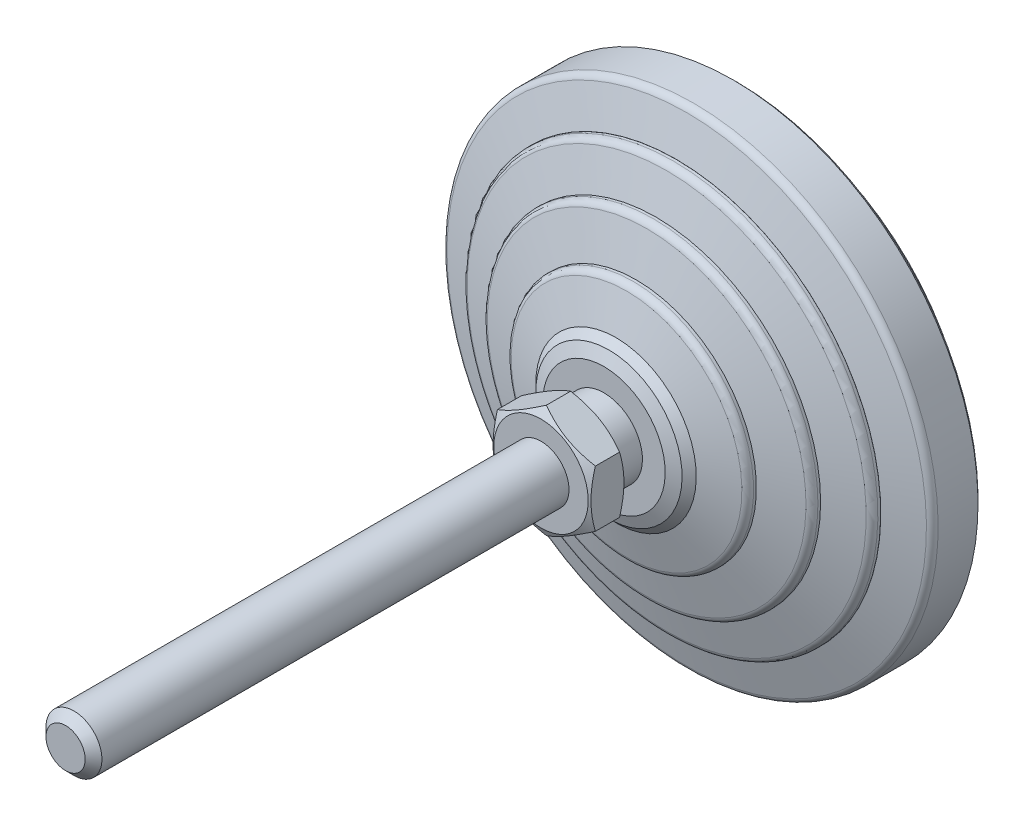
ISO-10303-21;
HEADER;
FILE_DESCRIPTION(('STEP AP214'),'2;1');
FILE_NAME('part.step','',(''),(''),'','','');
FILE_SCHEMA(('AUTOMOTIVE_DESIGN { 1 0 10303 214 1 1 1 1 }'));
ENDSEC;
DATA;
#1=APPLICATION_CONTEXT('core data for automotive mechanical design processes');
#2=APPLICATION_PROTOCOL_DEFINITION('international standard','automotive_design',2000,#1);
#3=PRODUCT_CONTEXT('',#1,'mechanical');
#4=PRODUCT('Part','Part','',(#3));
#5=PRODUCT_RELATED_PRODUCT_CATEGORY('part','',(#4));
#6=PRODUCT_DEFINITION_FORMATION('','',#4);
#7=PRODUCT_DEFINITION_CONTEXT('part definition',#1,'design');
#8=PRODUCT_DEFINITION('design','',#6,#7);
#9=PRODUCT_DEFINITION_SHAPE('','',#8);
#10=(LENGTH_UNIT() NAMED_UNIT(*) SI_UNIT(.MILLI.,.METRE.));
#11=(NAMED_UNIT(*) PLANE_ANGLE_UNIT() SI_UNIT($,.RADIAN.));
#12=(NAMED_UNIT(*) SI_UNIT($,.STERADIAN.) SOLID_ANGLE_UNIT());
#13=UNCERTAINTY_MEASURE_WITH_UNIT(LENGTH_MEASURE(1.E-05),#10,'distance_accuracy_value','');
#14=(GEOMETRIC_REPRESENTATION_CONTEXT(3) GLOBAL_UNCERTAINTY_ASSIGNED_CONTEXT((#13)) GLOBAL_UNIT_ASSIGNED_CONTEXT((#10,
#11,#12)) REPRESENTATION_CONTEXT('',''));
#15=CARTESIAN_POINT('',(0.,0.,0.));
#16=DIRECTION('',(0.,0.,1.));
#17=DIRECTION('',(1.,0.,0.));
#18=AXIS2_PLACEMENT_3D('',#15,#16,#17);
#19=CARTESIAN_POINT('',(-5.49999999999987,0.,26.));
#20=DIRECTION('',(0.,0.,1.));
#21=DIRECTION('',(0.,-1.,0.));
#22=AXIS2_PLACEMENT_3D('',#19,#20,#21);
#23=PLANE('',#22);
#24=CARTESIAN_POINT('',(0.,0.,26.));
#25=DIRECTION('',(0.,0.,-1.));
#26=DIRECTION('',(-1.,0.,0.));
#27=AXIS2_PLACEMENT_3D('',#24,#25,#26);
#28=CIRCLE('',#27,6.75);
#29=CARTESIAN_POINT('',(-6.75,0.,26.));
#30=VERTEX_POINT('',#29);
#31=EDGE_CURVE('E596',#30,#30,#28,.T.);
#32=ORIENTED_EDGE('',*,*,#31,.T.);
#33=EDGE_LOOP('',(#32));
#34=FACE_BOUND('',#33,.T.);
#35=CARTESIAN_POINT('',(0.,0.,26.));
#36=DIRECTION('',(0.,0.,-1.));
#37=DIRECTION('',(0.,1.,0.));
#38=AXIS2_PLACEMENT_3D('',#35,#36,#37);
#39=CIRCLE('',#38,5.49999999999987);
#40=CARTESIAN_POINT('',(0.,5.49999999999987,26.));
#41=VERTEX_POINT('',#40);
#42=EDGE_CURVE('E156',#41,#41,#39,.T.);
#43=ORIENTED_EDGE('',*,*,#42,.F.);
#44=EDGE_LOOP('',(#43));
#45=FACE_BOUND('',#44,.T.);
#46=ADVANCED_FACE('F14',(#34,#45),#23,.F.);
#47=CARTESIAN_POINT('',(0.,0.,0.));
#48=DIRECTION('',(0.,0.,-1.));
#49=DIRECTION('',(0.,1.,0.));
#50=AXIS2_PLACEMENT_3D('',#47,#48,#49);
#51=CYLINDRICAL_SURFACE('',#50,5.49999999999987);
#52=CARTESIAN_POINT('',(0.,0.,22.));
#53=DIRECTION('',(0.,0.,-1.));
#54=DIRECTION('',(0.,1.,0.));
#55=AXIS2_PLACEMENT_3D('',#52,#53,#54);
#56=CIRCLE('',#55,5.49999999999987);
#57=CARTESIAN_POINT('',(0.,5.49999999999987,22.));
#58=VERTEX_POINT('',#57);
#59=EDGE_CURVE('E153',#58,#58,#56,.T.);
#60=ORIENTED_EDGE('',*,*,#59,.F.);
#61=EDGE_LOOP('',(#60));
#62=FACE_BOUND('',#61,.T.);
#63=ORIENTED_EDGE('',*,*,#42,.T.);
#64=EDGE_LOOP('',(#63));
#65=FACE_BOUND('',#64,.T.);
#66=ADVANCED_FACE('F180',(#62,#65),#51,.T.);
#67=CARTESIAN_POINT('',(-8.7540983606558,0.,22.));
#68=DIRECTION('',(0.,0.,-1.));
#69=DIRECTION('',(0.,1.,0.));
#70=AXIS2_PLACEMENT_3D('',#67,#68,#69);
#71=PLANE('',#70);
#72=CARTESIAN_POINT('',(0.,0.,22.));
#73=DIRECTION('',(0.,0.,-1.));
#74=DIRECTION('',(0.,1.,0.));
#75=AXIS2_PLACEMENT_3D('',#72,#73,#74);
#76=CIRCLE('',#75,8.7540983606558);
#77=CARTESIAN_POINT('',(0.,8.7540983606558,22.));
#78=VERTEX_POINT('',#77);
#79=EDGE_CURVE('E150',#78,#78,#76,.T.);
#80=ORIENTED_EDGE('',*,*,#79,.F.);
#81=EDGE_LOOP('',(#80));
#82=FACE_BOUND('',#81,.T.);
#83=ORIENTED_EDGE('',*,*,#59,.T.);
#84=EDGE_LOOP('',(#83));
#85=FACE_BOUND('',#84,.T.);
#86=ADVANCED_FACE('F187',(#82,#85),#71,.F.);
#87=CARTESIAN_POINT('',(0.,0.,22.));
#88=DIRECTION('',(0.,0.,-1.));
#89=DIRECTION('',(0.,1.,0.));
#90=AXIS2_PLACEMENT_3D('',#87,#88,#89);
#91=CONICAL_SURFACE('',#90,8.7540983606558,1.17809724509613);
#92=CARTESIAN_POINT('',(0.,0.,21.2928932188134));
#93=DIRECTION('',(0.,0.,-1.));
#94=DIRECTION('',(0.,1.,0.));
#95=AXIS2_PLACEMENT_3D('',#92,#93,#94);
#96=CIRCLE('',#95,10.4612051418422);
#97=CARTESIAN_POINT('',(0.,10.4612051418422,21.2928932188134));
#98=VERTEX_POINT('',#97);
#99=EDGE_CURVE('E147',#98,#98,#96,.T.);
#100=ORIENTED_EDGE('',*,*,#99,.F.);
#101=EDGE_LOOP('',(#100));
#102=FACE_BOUND('',#101,.T.);
#103=ORIENTED_EDGE('',*,*,#79,.T.);
#104=EDGE_LOOP('',(#103));
#105=FACE_BOUND('',#104,.T.);
#106=ADVANCED_FACE('F459',(#102,#105),#91,.T.);
#107=CARTESIAN_POINT('',(0.,0.,21.2928932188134));
#108=DIRECTION('',(0.,0.,-1.));
#109=DIRECTION('',(0.,1.,0.));
#110=AXIS2_PLACEMENT_3D('',#107,#108,#109);
#111=CONICAL_SURFACE('',#110,10.4612051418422,0.785398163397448);
#112=CARTESIAN_POINT('',(0.,0.,20.2786885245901));
#113=DIRECTION('',(0.,0.,-1.));
#114=DIRECTION('',(0.,1.,0.));
#115=AXIS2_PLACEMENT_3D('',#112,#113,#114);
#116=CIRCLE('',#115,11.4754098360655);
#117=CARTESIAN_POINT('',(0.,11.4754098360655,20.2786885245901));
#118=VERTEX_POINT('',#117);
#119=EDGE_CURVE('E144',#118,#118,#116,.T.);
#120=ORIENTED_EDGE('',*,*,#119,.F.);
#121=EDGE_LOOP('',(#120));
#122=FACE_BOUND('',#121,.T.);
#123=ORIENTED_EDGE('',*,*,#99,.T.);
#124=EDGE_LOOP('',(#123));
#125=FACE_BOUND('',#124,.T.);
#126=ADVANCED_FACE('F449',(#122,#125),#111,.T.);
#127=CARTESIAN_POINT('',(0.,0.,20.2786885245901));
#128=DIRECTION('',(0.,0.,-1.));
#129=DIRECTION('',(0.,1.,0.));
#130=AXIS2_PLACEMENT_3D('',#127,#128,#129);
#131=CONICAL_SURFACE('',#130,11.4754098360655,1.27933953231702);
#132=CARTESIAN_POINT('',(0.,0.,18.7711726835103));
#133=DIRECTION('',(0.,0.,-1.));
#134=DIRECTION('',(0.,1.,0.));
#135=AXIS2_PLACEMENT_3D('',#132,#133,#134);
#136=CIRCLE('',#135,16.5004626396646);
#137=CARTESIAN_POINT('',(0.,16.5004626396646,18.7711726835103));
#138=VERTEX_POINT('',#137);
#139=EDGE_CURVE('E141',#138,#138,#136,.T.);
#140=ORIENTED_EDGE('',*,*,#139,.F.);
#141=EDGE_LOOP('',(#140));
#142=FACE_BOUND('',#141,.T.);
#143=ORIENTED_EDGE('',*,*,#119,.T.);
#144=EDGE_LOOP('',(#143));
#145=FACE_BOUND('',#144,.T.);
#146=ADVANCED_FACE('F439',(#142,#145),#131,.T.);
#147=CARTESIAN_POINT('',(0.,0.,17.8133463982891));
#148=DIRECTION('',(0.,0.,-1.));
#149=DIRECTION('',(0.,1.,0.));
#150=AXIS2_PLACEMENT_3D('',#147,#148,#149);
#151=TOROIDAL_SURFACE('',#150,16.2131147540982,1.);
#152=CARTESIAN_POINT('',(0.,0.,17.8133463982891));
#153=DIRECTION('',(0.,0.,-1.));
#154=DIRECTION('',(0.,1.,0.));
#155=AXIS2_PLACEMENT_3D('',#152,#153,#154);
#156=CIRCLE('',#155,17.2131147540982);
#157=CARTESIAN_POINT('',(0.,17.2131147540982,17.8133463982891));
#158=VERTEX_POINT('',#157);
#159=EDGE_CURVE('E138',#158,#158,#156,.T.);
#160=ORIENTED_EDGE('',*,*,#159,.F.);
#161=EDGE_LOOP('',(#160));
#162=FACE_BOUND('',#161,.T.);
#163=ORIENTED_EDGE('',*,*,#139,.T.);
#164=EDGE_LOOP('',(#163));
#165=FACE_BOUND('',#164,.T.);
#166=ADVANCED_FACE('F429',(#162,#165),#151,.T.);
#167=CARTESIAN_POINT('',(0.,0.,0.));
#168=DIRECTION('',(0.,0.,-1.));
#169=DIRECTION('',(0.,1.,0.));
#170=AXIS2_PLACEMENT_3D('',#167,#168,#169);
#171=CYLINDRICAL_SURFACE('',#170,17.2131147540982);
#172=CARTESIAN_POINT('',(0.,0.,17.4098360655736));
#173=DIRECTION('',(0.,0.,-1.));
#174=DIRECTION('',(0.,1.,0.));
#175=AXIS2_PLACEMENT_3D('',#172,#173,#174);
#176=CIRCLE('',#175,17.2131147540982);
#177=CARTESIAN_POINT('',(0.,17.2131147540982,17.4098360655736));
#178=VERTEX_POINT('',#177);
#179=EDGE_CURVE('E135',#178,#178,#176,.T.);
#180=ORIENTED_EDGE('',*,*,#179,.F.);
#181=EDGE_LOOP('',(#180));
#182=FACE_BOUND('',#181,.T.);
#183=ORIENTED_EDGE('',*,*,#159,.T.);
#184=EDGE_LOOP('',(#183));
#185=FACE_BOUND('',#184,.T.);
#186=ADVANCED_FACE('F419',(#182,#185),#171,.T.);
#187=CARTESIAN_POINT('',(0.,0.,17.4098360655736));
#188=DIRECTION('',(0.,0.,-1.));
#189=DIRECTION('',(0.,1.,0.));
#190=AXIS2_PLACEMENT_3D('',#187,#188,#189);
#191=CONICAL_SURFACE('',#190,17.2131147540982,1.30454427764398);
#192=CARTESIAN_POINT('',(0.,0.,15.8894925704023));
#193=DIRECTION('',(0.,0.,-1.));
#194=DIRECTION('',(0.,1.,0.));
#195=AXIS2_PLACEMENT_3D('',#192,#193,#194);
#196=CIRCLE('',#195,22.7877075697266);
#197=CARTESIAN_POINT('',(0.,22.7877075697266,15.8894925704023));
#198=VERTEX_POINT('',#197);
#199=EDGE_CURVE('E132',#198,#198,#196,.T.);
#200=ORIENTED_EDGE('',*,*,#199,.F.);
#201=EDGE_LOOP('',(#200));
#202=FACE_BOUND('',#201,.T.);
#203=ORIENTED_EDGE('',*,*,#179,.T.);
#204=EDGE_LOOP('',(#203));
#205=FACE_BOUND('',#204,.T.);
#206=ADVANCED_FACE('F409',(#202,#205),#191,.T.);
#207=CARTESIAN_POINT('',(0.,0.,14.9247287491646));
#208=DIRECTION('',(0.,0.,-1.));
#209=DIRECTION('',(0.,1.,0.));
#210=AXIS2_PLACEMENT_3D('',#207,#208,#209);
#211=TOROIDAL_SURFACE('',#210,22.5245901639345,1.);
#212=CARTESIAN_POINT('',(0.,0.,14.9247287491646));
#213=DIRECTION('',(0.,0.,-1.));
#214=DIRECTION('',(0.,1.,0.));
#215=AXIS2_PLACEMENT_3D('',#212,#213,#214);
#216=CIRCLE('',#215,23.5245901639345);
#217=CARTESIAN_POINT('',(0.,23.5245901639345,14.9247287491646));
#218=VERTEX_POINT('',#217);
#219=EDGE_CURVE('E129',#218,#218,#216,.T.);
#220=ORIENTED_EDGE('',*,*,#219,.F.);
#221=EDGE_LOOP('',(#220));
#222=FACE_BOUND('',#221,.T.);
#223=ORIENTED_EDGE('',*,*,#199,.T.);
#224=EDGE_LOOP('',(#223));
#225=FACE_BOUND('',#224,.T.);
#226=ADVANCED_FACE('F399',(#222,#225),#211,.T.);
#227=CARTESIAN_POINT('',(0.,0.,0.));
#228=DIRECTION('',(0.,0.,-1.));
#229=DIRECTION('',(0.,1.,0.));
#230=AXIS2_PLACEMENT_3D('',#227,#228,#229);
#231=CYLINDRICAL_SURFACE('',#230,23.5245901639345);
#232=CARTESIAN_POINT('',(0.,0.,14.5409836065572));
#233=DIRECTION('',(0.,0.,-1.));
#234=DIRECTION('',(0.,1.,0.));
#235=AXIS2_PLACEMENT_3D('',#232,#233,#234);
#236=CIRCLE('',#235,23.5245901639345);
#237=CARTESIAN_POINT('',(0.,23.5245901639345,14.5409836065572));
#238=VERTEX_POINT('',#237);
#239=EDGE_CURVE('E126',#238,#238,#236,.T.);
#240=ORIENTED_EDGE('',*,*,#239,.F.);
#241=EDGE_LOOP('',(#240));
#242=FACE_BOUND('',#241,.T.);
#243=ORIENTED_EDGE('',*,*,#219,.T.);
#244=EDGE_LOOP('',(#243));
#245=FACE_BOUND('',#244,.T.);
#246=ADVANCED_FACE('F389',(#242,#245),#231,.T.);
#247=CARTESIAN_POINT('',(0.,0.,14.5409836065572));
#248=DIRECTION('',(0.,0.,-1.));
#249=DIRECTION('',(0.,1.,0.));
#250=AXIS2_PLACEMENT_3D('',#247,#248,#249);
#251=CONICAL_SURFACE('',#250,23.5245901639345,1.2787125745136);
#252=CARTESIAN_POINT('',(0.,0.,13.0337743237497));
#253=DIRECTION('',(0.,0.,-1.));
#254=DIRECTION('',(0.,1.,0.));
#255=AXIS2_PLACEMENT_3D('',#252,#253,#254);
#256=CIRCLE('',#255,28.5372004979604);
#257=CARTESIAN_POINT('',(0.,28.5372004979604,13.0337743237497));
#258=VERTEX_POINT('',#257);
#259=EDGE_CURVE('E123',#258,#258,#256,.T.);
#260=ORIENTED_EDGE('',*,*,#259,.F.);
#261=EDGE_LOOP('',(#260));
#262=FACE_BOUND('',#261,.T.);
#263=ORIENTED_EDGE('',*,*,#239,.T.);
#264=EDGE_LOOP('',(#263));
#265=FACE_BOUND('',#264,.T.);
#266=ADVANCED_FACE('F379',(#262,#265),#251,.T.);
#267=CARTESIAN_POINT('',(0.,0.,12.0761283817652));
#268=DIRECTION('',(0.,0.,-1.));
#269=DIRECTION('',(0.,1.,0.));
#270=AXIS2_PLACEMENT_3D('',#267,#268,#269);
#271=TOROIDAL_SURFACE('',#270,28.2492521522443,1.);
#272=CARTESIAN_POINT('',(0.,0.,12.0761283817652));
#273=DIRECTION('',(0.,0.,-1.));
#274=DIRECTION('',(0.,1.,0.));
#275=AXIS2_PLACEMENT_3D('',#272,#273,#274);
#276=CIRCLE('',#275,29.2492521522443);
#277=CARTESIAN_POINT('',(0.,29.2492521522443,12.0761283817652));
#278=VERTEX_POINT('',#277);
#279=EDGE_CURVE('E120',#278,#278,#276,.T.);
#280=ORIENTED_EDGE('',*,*,#279,.F.);
#281=EDGE_LOOP('',(#280));
#282=FACE_BOUND('',#281,.T.);
#283=ORIENTED_EDGE('',*,*,#259,.T.);
#284=EDGE_LOOP('',(#283));
#285=FACE_BOUND('',#284,.T.);
#286=ADVANCED_FACE('F369',(#282,#285),#271,.T.);
#287=CARTESIAN_POINT('',(0.,0.,0.));
#288=DIRECTION('',(0.,0.,-1.));
#289=DIRECTION('',(0.,1.,0.));
#290=AXIS2_PLACEMENT_3D('',#287,#288,#289);
#291=CYLINDRICAL_SURFACE('',#290,29.2492521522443);
#292=CARTESIAN_POINT('',(0.,0.,11.6721311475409));
#293=DIRECTION('',(0.,0.,-1.));
#294=DIRECTION('',(0.,1.,0.));
#295=AXIS2_PLACEMENT_3D('',#292,#293,#294);
#296=CIRCLE('',#295,29.2492521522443);
#297=CARTESIAN_POINT('',(0.,29.2492521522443,11.6721311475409));
#298=VERTEX_POINT('',#297);
#299=EDGE_CURVE('E117',#298,#298,#296,.T.);
#300=ORIENTED_EDGE('',*,*,#299,.F.);
#301=EDGE_LOOP('',(#300));
#302=FACE_BOUND('',#301,.T.);
#303=ORIENTED_EDGE('',*,*,#279,.T.);
#304=EDGE_LOOP('',(#303));
#305=FACE_BOUND('',#304,.T.);
#306=ADVANCED_FACE('F359',(#302,#305),#291,.T.);
#307=CARTESIAN_POINT('',(-29.2622950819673,0.,11.6721311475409));
#308=DIRECTION('',(0.,0.,-1.));
#309=DIRECTION('',(0.,1.,0.));
#310=AXIS2_PLACEMENT_3D('',#307,#308,#309);
#311=PLANE('',#310);
#312=CARTESIAN_POINT('',(0.,0.,11.6721311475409));
#313=DIRECTION('',(0.,0.,-1.));
#314=DIRECTION('',(0.,1.,0.));
#315=AXIS2_PLACEMENT_3D('',#312,#313,#314);
#316=CIRCLE('',#315,29.2622950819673);
#317=CARTESIAN_POINT('',(0.,29.2622950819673,11.6721311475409));
#318=VERTEX_POINT('',#317);
#319=EDGE_CURVE('E114',#318,#318,#316,.T.);
#320=ORIENTED_EDGE('',*,*,#319,.F.);
#321=EDGE_LOOP('',(#320));
#322=FACE_BOUND('',#321,.T.);
#323=ORIENTED_EDGE('',*,*,#299,.T.);
#324=EDGE_LOOP('',(#323));
#325=FACE_BOUND('',#324,.T.);
#326=ADVANCED_FACE('F349',(#322,#325),#311,.F.);
#327=CARTESIAN_POINT('',(0.,0.,11.6721311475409));
#328=DIRECTION('',(0.,0.,-1.));
#329=DIRECTION('',(0.,1.,0.));
#330=AXIS2_PLACEMENT_3D('',#327,#328,#329);
#331=CONICAL_SURFACE('',#330,29.2622950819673,1.27933953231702);
#332=CARTESIAN_POINT('',(0.,0.,10.1646153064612));
#333=DIRECTION('',(0.,0.,-1.));
#334=DIRECTION('',(0.,1.,0.));
#335=AXIS2_PLACEMENT_3D('',#332,#333,#334);
#336=CIRCLE('',#335,34.2873478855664);
#337=CARTESIAN_POINT('',(0.,34.2873478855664,10.1646153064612));
#338=VERTEX_POINT('',#337);
#339=EDGE_CURVE('E111',#338,#338,#336,.T.);
#340=ORIENTED_EDGE('',*,*,#339,.F.);
#341=EDGE_LOOP('',(#340));
#342=FACE_BOUND('',#341,.T.);
#343=ORIENTED_EDGE('',*,*,#319,.T.);
#344=EDGE_LOOP('',(#343));
#345=FACE_BOUND('',#344,.T.);
#346=ADVANCED_FACE('F339',(#342,#345),#331,.T.);
#347=CARTESIAN_POINT('',(0.,0.,9.20678902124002));
#348=DIRECTION('',(0.,0.,-1.));
#349=DIRECTION('',(0.,1.,0.));
#350=AXIS2_PLACEMENT_3D('',#347,#348,#349);
#351=TOROIDAL_SURFACE('',#350,34.,1.);
#352=CARTESIAN_POINT('',(0.,0.,9.20678902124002));
#353=DIRECTION('',(0.,0.,-1.));
#354=DIRECTION('',(0.,1.,0.));
#355=AXIS2_PLACEMENT_3D('',#352,#353,#354);
#356=CIRCLE('',#355,35.);
#357=CARTESIAN_POINT('',(0.,35.,9.20678902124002));
#358=VERTEX_POINT('',#357);
#359=EDGE_CURVE('E108',#358,#358,#356,.T.);
#360=ORIENTED_EDGE('',*,*,#359,.F.);
#361=EDGE_LOOP('',(#360));
#362=FACE_BOUND('',#361,.T.);
#363=ORIENTED_EDGE('',*,*,#339,.T.);
#364=EDGE_LOOP('',(#363));
#365=FACE_BOUND('',#364,.T.);
#366=ADVANCED_FACE('F329',(#362,#365),#351,.T.);
#367=CARTESIAN_POINT('',(0.,0.,0.));
#368=DIRECTION('',(0.,0.,-1.));
#369=DIRECTION('',(0.,1.,0.));
#370=AXIS2_PLACEMENT_3D('',#367,#368,#369);
#371=CYLINDRICAL_SURFACE('',#370,35.);
#372=CARTESIAN_POINT('',(0.,0.,3.5));
#373=DIRECTION('',(0.,0.,-1.));
#374=DIRECTION('',(0.,1.,0.));
#375=AXIS2_PLACEMENT_3D('',#372,#373,#374);
#376=CIRCLE('',#375,35.);
#377=CARTESIAN_POINT('',(0.,35.,3.5));
#378=VERTEX_POINT('',#377);
#379=EDGE_CURVE('E105',#378,#378,#376,.T.);
#380=ORIENTED_EDGE('',*,*,#379,.F.);
#381=EDGE_LOOP('',(#380));
#382=FACE_BOUND('',#381,.T.);
#383=ORIENTED_EDGE('',*,*,#359,.T.);
#384=EDGE_LOOP('',(#383));
#385=FACE_BOUND('',#384,.T.);
#386=ADVANCED_FACE('F319',(#382,#385),#371,.T.);
#387=CARTESIAN_POINT('',(0.,0.,3.5));
#388=DIRECTION('',(0.,0.,1.));
#389=DIRECTION('',(0.,-1.,0.));
#390=AXIS2_PLACEMENT_3D('',#387,#388,#389);
#391=CONICAL_SURFACE('',#390,35.,0.785398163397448);
#392=CARTESIAN_POINT('',(0.,0.,3.));
#393=DIRECTION('',(0.,0.,-1.));
#394=DIRECTION('',(0.,1.,0.));
#395=AXIS2_PLACEMENT_3D('',#392,#393,#394);
#396=CIRCLE('',#395,34.5);
#397=CARTESIAN_POINT('',(0.,34.5,3.));
#398=VERTEX_POINT('',#397);
#399=EDGE_CURVE('E102',#398,#398,#396,.T.);
#400=ORIENTED_EDGE('',*,*,#399,.F.);
#401=EDGE_LOOP('',(#400));
#402=FACE_BOUND('',#401,.T.);
#403=ORIENTED_EDGE('',*,*,#379,.T.);
#404=EDGE_LOOP('',(#403));
#405=FACE_BOUND('',#404,.T.);
#406=ADVANCED_FACE('F309',(#402,#405),#391,.T.);
#407=CARTESIAN_POINT('',(-34.5,0.,3.));
#408=DIRECTION('',(0.,0.,1.));
#409=DIRECTION('',(0.,-1.,0.));
#410=AXIS2_PLACEMENT_3D('',#407,#408,#409);
#411=PLANE('',#410);
#412=CARTESIAN_POINT('',(0.,0.,3.));
#413=DIRECTION('',(0.,0.,-1.));
#414=DIRECTION('',(0.,1.,0.));
#415=AXIS2_PLACEMENT_3D('',#412,#413,#414);
#416=CIRCLE('',#415,30.4098360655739);
#417=CARTESIAN_POINT('',(0.,30.4098360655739,3.));
#418=VERTEX_POINT('',#417);
#419=EDGE_CURVE('E99',#418,#418,#416,.T.);
#420=ORIENTED_EDGE('',*,*,#419,.F.);
#421=EDGE_LOOP('',(#420));
#422=FACE_BOUND('',#421,.T.);
#423=ORIENTED_EDGE('',*,*,#399,.T.);
#424=EDGE_LOOP('',(#423));
#425=FACE_BOUND('',#424,.T.);
#426=ADVANCED_FACE('F299',(#422,#425),#411,.F.);
#427=CARTESIAN_POINT('',(0.,0.,0.));
#428=DIRECTION('',(0.,0.,-1.));
#429=DIRECTION('',(0.,1.,0.));
#430=AXIS2_PLACEMENT_3D('',#427,#428,#429);
#431=CYLINDRICAL_SURFACE('',#430,30.4098360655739);
#432=CARTESIAN_POINT('',(0.,0.,0.));
#433=DIRECTION('',(0.,0.,-1.));
#434=DIRECTION('',(0.,1.,0.));
#435=AXIS2_PLACEMENT_3D('',#432,#433,#434);
#436=CIRCLE('',#435,30.4098360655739);
#437=CARTESIAN_POINT('',(0.,30.4098360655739,0.));
#438=VERTEX_POINT('',#437);
#439=EDGE_CURVE('E96',#438,#438,#436,.T.);
#440=ORIENTED_EDGE('',*,*,#439,.F.);
#441=EDGE_LOOP('',(#440));
#442=FACE_BOUND('',#441,.T.);
#443=ORIENTED_EDGE('',*,*,#419,.T.);
#444=EDGE_LOOP('',(#443));
#445=FACE_BOUND('',#444,.T.);
#446=ADVANCED_FACE('F288',(#442,#445),#431,.T.);
#447=CARTESIAN_POINT('',(-30.4098360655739,0.,0.));
#448=DIRECTION('',(0.,0.,1.));
#449=DIRECTION('',(0.,-1.,0.));
#450=AXIS2_PLACEMENT_3D('',#447,#448,#449);
#451=PLANE('',#450);
#452=ORIENTED_EDGE('',*,*,#439,.T.);
#453=EDGE_LOOP('',(#452));
#454=FACE_BOUND('',#453,.T.);
#455=ADVANCED_FACE('F178',(#454),#451,.F.);
#456=CARTESIAN_POINT('',(0.,0.,27.4402554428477));
#457=DIRECTION('',(0.,0.,1.));
#458=DIRECTION('',(1.,0.,0.));
#459=AXIS2_PLACEMENT_3D('',#456,#457,#458);
#460=CONICAL_SURFACE('',#459,9.24459560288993,1.0471975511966);
#461=CARTESIAN_POINT('',(0.257255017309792,-8.23143002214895,26.8576243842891));
#462=CARTESIAN_POINT('',(-0.0693907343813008,-8.04284100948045,26.7428915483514));
#463=CARTESIAN_POINT('',(-0.399091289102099,-7.85248830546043,26.6378823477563));
#464=CARTESIAN_POINT('',(-1.06487190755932,-7.46809968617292,26.4535254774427));
#465=CARTESIAN_POINT('',(-1.40096884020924,-7.27405403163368,26.3742599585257));
#466=CARTESIAN_POINT('',(-1.90369568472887,-6.98380455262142,26.280776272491));
#467=CARTESIAN_POINT('',(-2.06857770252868,-6.88860987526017,26.2540708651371));
#468=CARTESIAN_POINT('',(-2.39920495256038,-6.69772214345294,26.2090103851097));
#469=CARTESIAN_POINT('',(-2.5649501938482,-6.60202908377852,26.1906554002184));
#470=CARTESIAN_POINT('',(-2.89673406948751,-6.41047357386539,26.1628195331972));
#471=CARTESIAN_POINT('',(-3.06277179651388,-6.31461164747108,26.1533243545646));
#472=CARTESIAN_POINT('',(-3.39505147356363,-6.12276988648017,26.1434284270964));
#473=CARTESIAN_POINT('',(-3.56129342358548,-6.02679005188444,26.1430276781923));
#474=CARTESIAN_POINT('',(-3.9039778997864,-5.82894107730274,26.1515939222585));
#475=CARTESIAN_POINT('',(-4.08040953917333,-5.72707822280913,26.1611471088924));
#476=CARTESIAN_POINT('',(-4.43265388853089,-5.52370985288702,26.1902259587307));
#477=CARTESIAN_POINT('',(-4.6084665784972,-5.42220434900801,26.2097519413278));
#478=CARTESIAN_POINT('',(-4.9594417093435,-5.21956876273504,26.2582266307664));
#479=CARTESIAN_POINT('',(-5.13460230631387,-5.11843974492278,26.2871929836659));
#480=CARTESIAN_POINT('',(-5.48369390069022,-4.91689161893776,26.3537446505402));
#481=CARTESIAN_POINT('',(-5.65762480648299,-4.8164725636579,26.3913305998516));
#482=CARTESIAN_POINT('',(-6.00962360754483,-4.61324596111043,26.475546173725));
#483=CARTESIAN_POINT('',(-6.18764626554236,-4.5104645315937,26.5224262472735));
#484=CARTESIAN_POINT('',(-6.54215877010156,-4.30578664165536,26.6234088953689));
#485=CARTESIAN_POINT('',(-6.71864845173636,-4.20389027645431,26.6775122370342));
#486=CARTESIAN_POINT('',(-7.06936165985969,-4.00140591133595,26.7917377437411));
#487=CARTESIAN_POINT('',(-7.24359154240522,-3.90081424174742,26.851834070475));
#488=CARTESIAN_POINT('',(-7.5905329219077,-3.70050754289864,26.9773694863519));
#489=CARTESIAN_POINT('',(-7.76324496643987,-3.6007921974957,27.0428065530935));
#490=CARTESIAN_POINT('',(-7.93526760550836,-3.5014748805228,27.1105064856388));
#491=B_SPLINE_CURVE_WITH_KNOTS('',3,(#461,#462,#463,#464,#465,#466,#467,#468,#469,#470,#471,
#472,#473,#474,#475,#476,#477,#478,#479,#480,#481,#482,#483,#484,#485,#486,#487,#488,#489,#490),
.UNSPECIFIED.,.F.,.F.,(4,2,2,2,2,2,2,2,2,2,2,2,2,2,4),(0.,1.18347116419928,2.37068262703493,
2.94727327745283,3.5238699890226,4.09953466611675,4.67519933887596,5.2867907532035,
5.89840175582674,6.5111626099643,7.12396864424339,7.75634196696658,8.38878250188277,
9.01860541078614,9.64819091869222),.UNSPECIFIED.);
#492=CARTESIAN_POINT('',(0.,-8.08290376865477,26.7695523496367));
#493=VERTEX_POINT('',#492);
#494=CARTESIAN_POINT('',(-7.,-4.04145188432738,26.7695523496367));
#495=VERTEX_POINT('',#494);
#496=EDGE_CURVE('E73',#493,#495,#491,.T.);
#497=ORIENTED_EDGE('',*,*,#496,.T.);
#498=CARTESIAN_POINT('',(-7.,-10.7917063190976,29.5294354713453));
#499=CARTESIAN_POINT('',(-7.,-10.4865004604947,29.3816422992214));
#500=CARTESIAN_POINT('',(-7.,-10.1805870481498,29.2352849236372));
#501=CARTESIAN_POINT('',(-7.,-9.56696857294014,28.9462506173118));
#502=CARTESIAN_POINT('',(-7.,-9.25926323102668,28.8035742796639));
#503=CARTESIAN_POINT('',(-7.,-8.64006797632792,28.5219793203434));
#504=CARTESIAN_POINT('',(-7.,-8.32856653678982,28.383085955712));
#505=CARTESIAN_POINT('',(-7.,-7.70306354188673,28.1110696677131));
#506=CARTESIAN_POINT('',(-7.,-7.38906210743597,27.9779464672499));
#507=CARTESIAN_POINT('',(-7.,-6.74817833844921,27.7149411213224));
#508=CARTESIAN_POINT('',(-7.,-6.42120037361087,27.5852906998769));
#509=CARTESIAN_POINT('',(-7.,-5.76339621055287,27.3359584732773));
#510=CARTESIAN_POINT('',(-7.,-5.4325695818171,27.2162777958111));
#511=CARTESIAN_POINT('',(-7.,-4.76717798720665,26.9900743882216));
#512=CARTESIAN_POINT('',(-7.,-4.43262236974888,26.8835244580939));
#513=CARTESIAN_POINT('',(-7.,-3.75872508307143,26.6870422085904));
#514=CARTESIAN_POINT('',(-7.,-3.41938497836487,26.597104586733));
#515=CARTESIAN_POINT('',(-7.,-2.73753820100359,26.4386856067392));
#516=CARTESIAN_POINT('',(-7.,-2.39505870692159,26.3700904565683));
#517=CARTESIAN_POINT('',(-7.,-1.87827272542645,26.2862065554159));
#518=CARTESIAN_POINT('',(-7.,-1.70548642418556,26.2614122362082));
#519=CARTESIAN_POINT('',(-7.,-1.35907697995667,26.2186475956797));
#520=CARTESIAN_POINT('',(-7.,-1.18545391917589,26.2006766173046));
#521=CARTESIAN_POINT('',(-7.,-0.839843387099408,26.1721387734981));
#522=CARTESIAN_POINT('',(-7.,-0.667863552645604,26.1614797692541));
#523=CARTESIAN_POINT('',(-7.,-0.323607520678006,26.1474394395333));
#524=CARTESIAN_POINT('',(-7.,-0.151331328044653,26.144057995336));
#525=CARTESIAN_POINT('',(-7.,0.193210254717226,26.1446533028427));
#526=CARTESIAN_POINT('',(-7.,0.365475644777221,26.1486300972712));
#527=CARTESIAN_POINT('',(-7.,0.709687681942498,26.1638458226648));
#528=CARTESIAN_POINT('',(-7.,0.881634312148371,26.1750851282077));
#529=CARTESIAN_POINT('',(-7.,1.29683849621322,26.2107580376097));
#530=CARTESIAN_POINT('',(-7.,1.5397968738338,26.2387464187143));
#531=CARTESIAN_POINT('',(-7.,2.02385653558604,26.3076809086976));
#532=CARTESIAN_POINT('',(-7.,2.26495755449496,26.3486288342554));
#533=CARTESIAN_POINT('',(-7.,2.98522918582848,26.4887359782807));
#534=CARTESIAN_POINT('',(-7.,3.46108836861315,26.6051313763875));
#535=CARTESIAN_POINT('',(-7.,4.17254237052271,26.806291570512));
#536=CARTESIAN_POINT('',(-7.,4.41184436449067,26.8786932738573));
#537=CARTESIAN_POINT('',(-7.,4.88812297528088,27.0308469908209));
#538=CARTESIAN_POINT('',(-7.,5.12509957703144,27.1105990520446));
#539=CARTESIAN_POINT('',(-7.,5.59680526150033,27.2761880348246));
#540=CARTESIAN_POINT('',(-7.,5.83153509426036,27.3620228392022));
#541=CARTESIAN_POINT('',(-7.,6.29906142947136,27.5387843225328));
#542=CARTESIAN_POINT('',(-7.,6.53185795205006,27.6297109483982));
#543=CARTESIAN_POINT('',(-7.,7.07073101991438,27.8458946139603));
#544=CARTESIAN_POINT('',(-7.,7.37616636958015,27.9727467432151));
#545=CARTESIAN_POINT('',(-7.,7.9845297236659,28.2323438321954));
#546=CARTESIAN_POINT('',(-7.,8.28745758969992,28.3650891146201));
#547=CARTESIAN_POINT('',(-7.,8.89125364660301,28.6353181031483));
#548=CARTESIAN_POINT('',(-7.,9.19212144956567,28.7728026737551));
#549=CARTESIAN_POINT('',(-7.,9.79208788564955,29.0515859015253));
#550=CARTESIAN_POINT('',(-7.,10.0911864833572,29.1928846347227));
#551=CARTESIAN_POINT('',(-7.,10.6881886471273,29.4787365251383));
#552=CARTESIAN_POINT('',(-7.,10.9860907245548,29.6232927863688));
#553=CARTESIAN_POINT('',(-7.,11.5806319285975,29.9149818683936));
#554=CARTESIAN_POINT('',(-7.,11.8772710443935,30.0621147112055));
#555=CARTESIAN_POINT('',(-7.,12.7655168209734,30.5066719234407));
#556=CARTESIAN_POINT('',(-7.,13.3555248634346,30.8072901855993));
#557=CARTESIAN_POINT('',(-7.,14.4848272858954,31.390004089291));
#558=CARTESIAN_POINT('',(-7.,15.0243642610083,31.6716316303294));
#559=CARTESIAN_POINT('',(-7.,16.1014255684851,32.2387482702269));
#560=CARTESIAN_POINT('',(-7.,16.6389498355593,32.5242374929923));
#561=CARTESIAN_POINT('',(-7.,17.7111638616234,33.0974960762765));
#562=CARTESIAN_POINT('',(-7.,18.2458573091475,33.3852585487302));
#563=CARTESIAN_POINT('',(-7.,19.3139510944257,33.9631085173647));
#564=CARTESIAN_POINT('',(-7.,19.8473514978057,34.2531958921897));
#565=CARTESIAN_POINT('',(-7.,20.3802729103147,34.5441546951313));
#566=B_SPLINE_CURVE_WITH_KNOTS('',3,(#498,#499,#500,#501,#502,#503,#504,#505,#506,#507,#508,
#509,#510,#511,#512,#513,#514,#515,#516,#517,#518,#519,#520,#521,#522,#523,#524,#525,#526,#527,
#528,#529,#530,#531,#532,#533,#534,#535,#536,#537,#538,#539,#540,#541,#542,#543,#544,#545,#546,
#547,#548,#549,#550,#551,#552,#553,#554,#555,#556,#557,#558,#559,#560,#561,#562,#563,#564,#565),
.UNSPECIFIED.,.F.,.F.,(4,2,2,2,2,2,2,2,2,2,2,2,2,2,2,2,2,2,2,2,2,2,2,2,2,2,2,2,2,2,2,2,2,4),(0.,
1.01733320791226,2.03482931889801,3.05797385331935,4.08106919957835,5.13617501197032,
6.19140000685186,7.24440101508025,8.29706533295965,9.34401695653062,9.86757196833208,
10.391076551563,10.907856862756,11.4246287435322,11.9414036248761,12.4582051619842,
13.1914849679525,13.9248676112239,15.3924730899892,16.1424574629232,16.8924466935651,
17.6421761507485,18.3918977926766,19.3840050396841,20.3761666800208,21.3685102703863,
22.3608736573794,23.354226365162,24.3475875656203,26.3340669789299,28.1599001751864,
29.9857920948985,31.807416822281,33.6289470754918),.UNSPECIFIED.);
#567=CARTESIAN_POINT('',(-7.,4.04145188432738,26.7695523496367));
#568=VERTEX_POINT('',#567);
#569=EDGE_CURVE('E81',#495,#568,#566,.T.);
#570=ORIENTED_EDGE('',*,*,#569,.T.);
#571=CARTESIAN_POINT('',(-12.6702430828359,0.767735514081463,29.4314707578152));
#572=CARTESIAN_POINT('',(-12.4019431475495,0.922638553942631,29.2823066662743));
#573=CARTESIAN_POINT('',(-12.1329890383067,1.0779192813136,29.1346813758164));
#574=CARTESIAN_POINT('',(-11.5934117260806,1.38944438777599,28.8434049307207));
#575=CARTESIAN_POINT('',(-11.3227882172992,1.54568894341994,28.6997545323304));
#576=CARTESIAN_POINT('',(-10.7778965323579,1.8602823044,28.4164894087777));
#577=CARTESIAN_POINT('',(-10.5036161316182,2.01863816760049,28.2769059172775));
#578=CARTESIAN_POINT('',(-9.95271850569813,2.33669906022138,28.004054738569));
#579=CARTESIAN_POINT('',(-9.6761014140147,2.49640401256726,27.8707866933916));
#580=CARTESIAN_POINT('',(-9.11755183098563,2.81888276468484,27.6111198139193));
#581=CARTESIAN_POINT('',(-8.83559391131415,2.98167124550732,27.4847934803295));
#582=CARTESIAN_POINT('',(-8.26824885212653,3.3092280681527,27.2426515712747));
#583=CARTESIAN_POINT('',(-7.98286130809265,3.47399664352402,27.1268372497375));
#584=CARTESIAN_POINT('',(-7.4088651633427,3.80539347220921,26.9090708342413));
#585=CARTESIAN_POINT('',(-7.12026599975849,3.97201627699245,26.8070859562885));
#586=CARTESIAN_POINT('',(-6.53893302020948,4.30764902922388,26.6205177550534));
#587=CARTESIAN_POINT('',(-6.24620067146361,4.47665812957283,26.5359284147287));
#588=CARTESIAN_POINT('',(-5.66060279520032,4.81475322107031,26.3895957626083));
#589=CARTESIAN_POINT('',(-5.36779503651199,4.98380585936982,26.3275528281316));
#590=CARTESIAN_POINT('',(-4.9261893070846,5.23876704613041,26.2535833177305));
#591=CARTESIAN_POINT('',(-4.77856883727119,5.32399576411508,26.2321077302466));
#592=CARTESIAN_POINT('',(-4.48271000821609,5.49480993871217,26.1959472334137));
#593=CARTESIAN_POINT('',(-4.33447170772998,5.58039536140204,26.1812616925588));
#594=CARTESIAN_POINT('',(-4.03841382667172,5.75132445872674,26.159067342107));
#595=CARTESIAN_POINT('',(-3.89059645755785,5.83666685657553,26.1515193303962));
#596=CARTESIAN_POINT('',(-3.59481844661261,6.00743437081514,26.1436312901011));
#597=CARTESIAN_POINT('',(-3.44685780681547,6.09285948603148,26.1432911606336));
#598=CARTESIAN_POINT('',(-3.15109311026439,6.26361931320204,26.1498267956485));
#599=CARTESIAN_POINT('',(-3.00328902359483,6.34895404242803,26.1567007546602));
#600=CARTESIAN_POINT('',(-2.70805124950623,6.51940965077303,26.1775020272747));
#601=CARTESIAN_POINT('',(-2.56061758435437,6.60453051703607,26.191429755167));
#602=CARTESIAN_POINT('',(-2.19649329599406,6.81475777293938,26.2342592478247));
#603=CARTESIAN_POINT('',(-1.98014668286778,6.9396655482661,26.2671306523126));
#604=CARTESIAN_POINT('',(-1.54929118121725,7.18842008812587,26.3461717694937));
#605=CARTESIAN_POINT('',(-1.33478260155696,7.31226667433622,26.3923436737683));
#606=CARTESIAN_POINT('',(-0.693567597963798,7.68247232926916,26.5484743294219));
#607=CARTESIAN_POINT('',(-0.270027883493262,7.92700309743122,26.675935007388));
#608=CARTESIAN_POINT('',(0.3631383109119,8.29256177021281,26.8936276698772));
#609=CARTESIAN_POINT('',(0.576113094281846,8.41552281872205,26.9715955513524));
#610=CARTESIAN_POINT('',(1.00000649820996,8.66025778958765,27.1347892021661));
#611=CARTESIAN_POINT('',(1.21092494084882,8.78203160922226,27.2200155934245));
#612=CARTESIAN_POINT('',(1.62964728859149,9.0237810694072,27.3959401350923));
#613=CARTESIAN_POINT('',(1.83746214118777,9.14376303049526,27.4866038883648));
#614=CARTESIAN_POINT('',(2.25135745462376,9.38272560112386,27.6728461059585));
#615=CARTESIAN_POINT('',(2.45743846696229,9.50170652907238,27.7684229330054));
#616=CARTESIAN_POINT('',(2.66279483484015,9.62026908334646,27.8659882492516));
#617=B_SPLINE_CURVE_WITH_KNOTS('',3,(#571,#572,#573,#574,#575,#576,#577,#578,#579,#580,#581,
#582,#583,#584,#585,#586,#587,#588,#589,#590,#591,#592,#593,#594,#595,#596,#597,#598,#599,#600,
#601,#602,#603,#604,#605,#606,#607,#608,#609,#610,#611,#612,#613,#614,#615,#616),.UNSPECIFIED.,
.F.,.F.,(4,2,2,2,2,2,2,2,2,2,2,2,2,2,2,2,2,2,2,2,2,2,4),(0.,1.03155176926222,2.06329846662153,
3.10156412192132,4.13977085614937,5.1873083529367,6.23497064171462,7.28010423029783,
8.3248757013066,9.35520606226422,9.87050661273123,10.3857592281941,10.8981651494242,
11.4105638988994,11.9228344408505,12.4351350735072,13.1906072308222,13.9462039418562,
15.4603687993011,16.2342731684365,17.0082439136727,17.7777503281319,18.5470019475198),.UNSPECIFIED.);
#618=CARTESIAN_POINT('',(0.,8.08290376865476,26.7695523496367));
#619=VERTEX_POINT('',#618);
#620=EDGE_CURVE('E551',#568,#619,#617,.T.);
#621=ORIENTED_EDGE('',*,*,#620,.T.);
#622=CARTESIAN_POINT('',(-0.941569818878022,8.62651935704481,27.1129884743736));
#623=CARTESIAN_POINT('',(-0.769457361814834,8.52715018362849,27.045190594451));
#624=CARTESIAN_POINT('',(-0.596655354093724,8.4273828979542,26.9796540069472));
#625=CARTESIAN_POINT('',(-0.249533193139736,8.22697182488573,26.8539167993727));
#626=CARTESIAN_POINT('',(-0.075212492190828,8.12632772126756,26.7937182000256));
#627=CARTESIAN_POINT('',(0.275685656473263,7.9237365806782,26.6792849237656));
#628=CARTESIAN_POINT('',(0.452269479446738,7.82178586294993,26.6250761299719));
#629=CARTESIAN_POINT('',(0.806972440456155,7.61699801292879,26.5238814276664));
#630=CARTESIAN_POINT('',(0.985091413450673,7.51416097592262,26.4768947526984));
#631=CARTESIAN_POINT('',(1.33727970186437,7.31082497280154,26.3924705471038));
#632=CARTESIAN_POINT('',(1.51130366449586,7.2103521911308,26.3547824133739));
#633=CARTESIAN_POINT('',(1.86058478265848,7.00869464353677,26.2880288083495));
#634=CARTESIAN_POINT('',(2.03584184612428,6.9075099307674,26.2589627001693));
#635=CARTESIAN_POINT('',(2.38701325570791,6.70476102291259,26.2102939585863));
#636=CARTESIAN_POINT('',(2.56292574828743,6.60319789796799,26.1906736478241));
#637=CARTESIAN_POINT('',(2.91537369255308,6.39971198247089,26.1614144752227));
#638=CARTESIAN_POINT('',(3.09190912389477,6.29778920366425,26.1517752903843));
#639=CARTESIAN_POINT('',(3.43462154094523,6.09992409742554,26.1430576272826));
#640=CARTESIAN_POINT('',(3.60078725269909,6.00398827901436,26.1433826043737));
#641=CARTESIAN_POINT('',(3.93291778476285,5.81223262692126,26.1531198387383));
#642=CARTESIAN_POINT('',(4.09888260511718,5.71641279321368,26.1625320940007));
#643=CARTESIAN_POINT('',(4.4305235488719,5.52493980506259,26.1901973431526));
#644=CARTESIAN_POINT('',(4.59619877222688,5.42928717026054,26.2084646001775));
#645=CARTESIAN_POINT('',(4.92668925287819,5.2384784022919,26.2533473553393));
#646=CARTESIAN_POINT('',(5.09150451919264,5.14332226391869,26.2799627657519));
#647=CARTESIAN_POINT('',(5.59402400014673,4.85319250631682,26.3731698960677));
#648=CARTESIAN_POINT('',(5.92998493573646,4.65922536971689,26.4522482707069));
#649=CARTESIAN_POINT('',(6.5955039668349,4.27498777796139,26.6362411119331));
#650=CARTESIAN_POINT('',(6.92507885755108,4.08470762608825,26.7410736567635));
#651=CARTESIAN_POINT('',(7.25159958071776,3.89619079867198,26.8556392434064));
#652=B_SPLINE_CURVE_WITH_KNOTS('',3,(#622,#623,#624,#625,#626,#627,#628,#629,#630,#631,#632,
#633,#634,#635,#636,#637,#638,#639,#640,#641,#642,#643,#644,#645,#646,#647,#648,#649,#650,#651),
.UNSPECIFIED.,.F.,.F.,(4,2,2,2,2,2,2,2,2,2,2,2,2,2,4),(0.,0.629974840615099,1.26018715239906,
1.89302421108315,2.52579406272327,3.13897342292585,3.75210747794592,4.36408957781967,
4.97605187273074,5.55145235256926,6.12685270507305,6.70318297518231,7.27950718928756,
8.46614397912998,9.64905397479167),.UNSPECIFIED.);
#653=CARTESIAN_POINT('',(7.,4.04145188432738,26.7695523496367));
#654=VERTEX_POINT('',#653);
#655=EDGE_CURVE('E546',#619,#654,#652,.T.);
#656=ORIENTED_EDGE('',*,*,#655,.T.);
#657=CARTESIAN_POINT('',(7.,-10.7917063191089,29.5294354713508));
#658=CARTESIAN_POINT('',(7.,-10.4865004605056,29.3816422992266));
#659=CARTESIAN_POINT('',(7.,-10.1805870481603,29.2352849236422));
#660=CARTESIAN_POINT('',(7.,-9.56696857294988,28.9462506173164));
#661=CARTESIAN_POINT('',(7.,-9.25926323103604,28.8035742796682));
#662=CARTESIAN_POINT('',(7.,-8.64006797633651,28.5219793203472));
#663=CARTESIAN_POINT('',(7.,-8.32856653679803,28.3830859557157));
#664=CARTESIAN_POINT('',(7.,-7.70306354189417,28.1110696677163));
#665=CARTESIAN_POINT('',(7.,-7.38906210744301,27.9779464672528));
#666=CARTESIAN_POINT('',(7.,-6.74817833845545,27.7149411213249));
#667=CARTESIAN_POINT('',(7.,-6.42120037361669,27.5852906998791));
#668=CARTESIAN_POINT('',(7.,-5.76339621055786,27.3359584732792));
#669=CARTESIAN_POINT('',(7.,-5.43256958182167,27.2162777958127));
#670=CARTESIAN_POINT('',(7.,-4.76717798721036,26.9900743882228));
#671=CARTESIAN_POINT('',(7.,-4.43262236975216,26.8835244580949));
#672=CARTESIAN_POINT('',(7.,-3.75872508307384,26.6870422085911));
#673=CARTESIAN_POINT('',(7.,-3.41938497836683,26.5971045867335));
#674=CARTESIAN_POINT('',(7.,-2.73753820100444,26.4386856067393));
#675=CARTESIAN_POINT('',(7.,-2.39505870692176,26.3700904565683));
#676=CARTESIAN_POINT('',(7.,-1.87827272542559,26.2862065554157));
#677=CARTESIAN_POINT('',(7.,-1.70548642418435,26.2614122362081));
#678=CARTESIAN_POINT('',(7.,-1.35907697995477,26.2186475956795));
#679=CARTESIAN_POINT('',(7.,-1.18545391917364,26.2006766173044));
#680=CARTESIAN_POINT('',(7.,-0.839843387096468,26.1721387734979));
#681=CARTESIAN_POINT('',(7.,-0.667863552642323,26.1614797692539));
#682=CARTESIAN_POINT('',(7.,-0.323607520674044,26.1474394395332));
#683=CARTESIAN_POINT('',(7.,-0.151331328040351,26.144057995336));
#684=CARTESIAN_POINT('',(7.,0.193210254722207,26.1446533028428));
#685=CARTESIAN_POINT('',(7.,0.36547564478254,26.1486300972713));
#686=CARTESIAN_POINT('',(7.,0.709687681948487,26.1638458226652));
#687=CARTESIAN_POINT('',(7.,0.881634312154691,26.1750851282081));
#688=CARTESIAN_POINT('',(7.,1.29683849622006,26.2107580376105));
#689=CARTESIAN_POINT('',(7.,1.53979687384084,26.2387464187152));
#690=CARTESIAN_POINT('',(7.,2.02385653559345,26.3076809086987));
#691=CARTESIAN_POINT('',(7.,2.26495755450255,26.3486288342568));
#692=CARTESIAN_POINT('',(7.,2.98522918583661,26.4887359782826));
#693=CARTESIAN_POINT('',(7.,3.46108836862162,26.6051313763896));
#694=CARTESIAN_POINT('',(7.,4.1725423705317,26.8062915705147));
#695=CARTESIAN_POINT('',(7.,4.41184436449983,26.8786932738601));
#696=CARTESIAN_POINT('',(7.,4.88812297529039,27.030846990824));
#697=CARTESIAN_POINT('',(7.,5.12509957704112,27.1105990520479));
#698=CARTESIAN_POINT('',(7.,5.59680526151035,27.2761880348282));
#699=CARTESIAN_POINT('',(7.,5.83153509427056,27.362022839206));
#700=CARTESIAN_POINT('',(7.,6.2990614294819,27.5387843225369));
#701=CARTESIAN_POINT('',(7.,6.53185795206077,27.6297109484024));
#702=CARTESIAN_POINT('',(7.,7.07073101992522,27.8458946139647));
#703=CARTESIAN_POINT('',(7.,7.37616636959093,27.9727467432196));
#704=CARTESIAN_POINT('',(7.,7.98452972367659,28.2323438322));
#705=CARTESIAN_POINT('',(7.,8.28745758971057,28.3650891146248));
#706=CARTESIAN_POINT('',(7.,8.89125364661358,28.6353181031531));
#707=CARTESIAN_POINT('',(7.,9.19212144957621,28.7728026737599));
#708=CARTESIAN_POINT('',(7.,9.79208788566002,29.0515859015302));
#709=CARTESIAN_POINT('',(7.,10.0911864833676,29.1928846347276));
#710=CARTESIAN_POINT('',(7.,10.6881886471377,29.4787365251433));
#711=CARTESIAN_POINT('',(7.,10.9860907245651,29.6232927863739));
#712=CARTESIAN_POINT('',(7.,11.5806319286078,29.9149818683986));
#713=CARTESIAN_POINT('',(7.,11.8772710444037,30.0621147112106));
#714=CARTESIAN_POINT('',(7.,12.7655168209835,30.5066719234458));
#715=CARTESIAN_POINT('',(7.,13.3555248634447,30.8072901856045));
#716=CARTESIAN_POINT('',(7.,14.4848272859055,31.3900040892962));
#717=CARTESIAN_POINT('',(7.,15.0243642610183,31.6716316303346));
#718=CARTESIAN_POINT('',(7.,16.1014255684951,32.2387482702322));
#719=CARTESIAN_POINT('',(7.,16.6389498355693,32.5242374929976));
#720=CARTESIAN_POINT('',(7.,17.7111638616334,33.0974960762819));
#721=CARTESIAN_POINT('',(7.,18.2458573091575,33.3852585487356));
#722=CARTESIAN_POINT('',(7.,19.3139510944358,33.9631085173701));
#723=CARTESIAN_POINT('',(7.,19.8473514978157,34.2531958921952));
#724=CARTESIAN_POINT('',(7.,20.3802729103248,34.5441546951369));
#725=B_SPLINE_CURVE_WITH_KNOTS('',3,(#657,#658,#659,#660,#661,#662,#663,#664,#665,#666,#667,
#668,#669,#670,#671,#672,#673,#674,#675,#676,#677,#678,#679,#680,#681,#682,#683,#684,#685,#686,
#687,#688,#689,#690,#691,#692,#693,#694,#695,#696,#697,#698,#699,#700,#701,#702,#703,#704,#705,
#706,#707,#708,#709,#710,#711,#712,#713,#714,#715,#716,#717,#718,#719,#720,#721,#722,#723,#724),
.UNSPECIFIED.,.F.,.F.,(4,2,2,2,2,2,2,2,2,2,2,2,2,2,2,2,2,2,2,2,2,2,2,2,2,2,2,2,2,2,2,2,2,4),(0.,
1.01733320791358,2.03482931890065,3.05797385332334,4.08106919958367,5.13617501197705,
6.19140000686,7.24440101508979,8.29706533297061,9.34401695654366,9.86757196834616,
10.3910765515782,10.9078568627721,11.4246287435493,11.9414036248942,12.4582051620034,
13.1914849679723,13.9248676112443,15.3924730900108,16.1424574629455,16.892446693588,
17.6421761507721,18.3918977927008,19.3840050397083,20.3761666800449,21.3685102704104,
22.3608736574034,23.354226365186,24.3475875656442,26.3340669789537,28.1599001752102,
29.9857920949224,31.8074168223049,33.6289470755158),.UNSPECIFIED.);
#726=CARTESIAN_POINT('',(7.,-4.04145188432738,26.7695523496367));
#727=VERTEX_POINT('',#726);
#728=EDGE_CURVE('E34',#654,#727,#725,.F.);
#729=ORIENTED_EDGE('',*,*,#728,.T.);
#730=CARTESIAN_POINT('',(-5.67454717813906,-11.3591051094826,29.4338645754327));
#731=CARTESIAN_POINT('',(-5.40627516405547,-11.2042181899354,29.2846946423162));
#732=CARTESIAN_POINT('',(-5.13734969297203,-11.0489539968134,29.1370616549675));
#733=CARTESIAN_POINT('',(-4.59783164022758,-10.7374631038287,28.8457646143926));
#734=CARTESIAN_POINT('',(-4.32723875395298,-10.5812362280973,28.7021013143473));
#735=CARTESIAN_POINT('',(-3.7824153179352,-10.2666822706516,28.4188058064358));
#736=CARTESIAN_POINT('',(-3.50817259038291,-10.108348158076,28.2792047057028));
#737=CARTESIAN_POINT('',(-2.95735311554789,-9.79033238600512,28.006308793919));
#738=CARTESIAN_POINT('',(-2.68077650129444,-9.63065080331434,27.8730136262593));
#739=CARTESIAN_POINT('',(-2.12228213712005,-9.30820393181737,27.6132657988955));
#740=CARTESIAN_POINT('',(-1.84033868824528,-9.14542380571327,27.4868863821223));
#741=CARTESIAN_POINT('',(-1.27302556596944,-8.8178854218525,27.2446235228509));
#742=CARTESIAN_POINT('',(-0.987655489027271,-8.65312693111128,27.1287413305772));
#743=CARTESIAN_POINT('',(-0.413694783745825,-8.32175056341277,26.9108195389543));
#744=CARTESIAN_POINT('',(-0.125113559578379,-8.15513811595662,26.8087472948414));
#745=CARTESIAN_POINT('',(0.456182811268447,-7.81952649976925,26.6219814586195));
#746=CARTESIAN_POINT('',(0.748896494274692,-7.65052817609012,26.5372818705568));
#747=CARTESIAN_POINT('',(1.33453834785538,-7.31240769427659,26.3906857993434));
#748=CARTESIAN_POINT('',(1.62740982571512,-7.1433182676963,26.3284957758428));
#749=CARTESIAN_POINT('',(2.06911733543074,-6.88829831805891,26.2543010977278));
#750=CARTESIAN_POINT('',(2.21677271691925,-6.80304944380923,26.2327496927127));
#751=CARTESIAN_POINT('',(2.51270381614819,-6.63219354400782,26.1964374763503));
#752=CARTESIAN_POINT('',(2.66097947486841,-6.54658655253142,26.1816760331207));
#753=CARTESIAN_POINT('',(2.95711083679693,-6.3756150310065,26.1593320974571));
#754=CARTESIAN_POINT('',(3.10496430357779,-6.29025179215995,26.1517102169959));
#755=CARTESIAN_POINT('',(3.40081719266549,-6.11944104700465,26.1436773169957));
#756=CARTESIAN_POINT('',(3.5488166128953,-6.03399354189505,26.1432661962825));
#757=CARTESIAN_POINT('',(3.84466122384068,-5.86318757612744,26.149664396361));
#758=CARTESIAN_POINT('',(3.99250644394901,-5.77782909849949,26.156471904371));
#759=CARTESIAN_POINT('',(4.28782854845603,-5.60732480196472,26.1771461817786));
#760=CARTESIAN_POINT('',(4.43530541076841,-5.52217899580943,26.1910133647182));
#761=CARTESIAN_POINT('',(4.79932153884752,-5.31201418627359,26.2336761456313));
#762=CARTESIAN_POINT('',(5.01551896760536,-5.18719254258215,26.2664307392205));
#763=CARTESIAN_POINT('',(5.44608163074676,-4.93860707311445,26.345229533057));
#764=CARTESIAN_POINT('',(5.6604465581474,-4.81484342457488,26.3912759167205));
#765=CARTESIAN_POINT('',(6.30123637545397,-4.44488325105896,26.5470238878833));
#766=CARTESIAN_POINT('',(6.72450144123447,-4.20051105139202,26.6742218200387));
#767=CARTESIAN_POINT('',(7.35726909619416,-3.83518247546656,26.8915258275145));
#768=CARTESIAN_POINT('',(7.57011678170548,-3.71229480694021,26.9693658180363));
#769=CARTESIAN_POINT('',(7.99375710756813,-3.46770595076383,27.1323067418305));
#770=CARTESIAN_POINT('',(8.20454956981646,-3.34600486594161,27.2174082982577));
#771=CARTESIAN_POINT('',(8.62302187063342,-3.10439977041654,27.3930876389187));
#772=CARTESIAN_POINT('',(8.83071264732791,-2.98448944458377,27.483631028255));
#773=CARTESIAN_POINT('',(9.24435976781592,-2.74567016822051,27.6696358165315));
#774=CARTESIAN_POINT('',(9.45031666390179,-2.62676089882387,27.7650955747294));
#775=CARTESIAN_POINT('',(9.65554873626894,-2.50827010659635,27.8625454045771));
#776=B_SPLINE_CURVE_WITH_KNOTS('',3,(#730,#731,#732,#733,#734,#735,#736,#737,#738,#739,#740,
#741,#742,#743,#744,#745,#746,#747,#748,#749,#750,#751,#752,#753,#754,#755,#756,#757,#758,#759,
#760,#761,#762,#763,#764,#765,#766,#767,#768,#769,#770,#771,#772,#773,#774,#775),.UNSPECIFIED.,
.F.,.F.,(4,2,2,2,2,2,2,2,2,2,2,2,2,2,2,2,2,2,2,2,2,2,4),(0.,1.03147218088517,2.06313874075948,
3.10130643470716,4.13941534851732,5.18696410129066,6.23463745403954,7.27978929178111,
8.32457979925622,9.35520782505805,9.87065687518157,10.3860579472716,10.8985985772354,
11.4111320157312,11.9235367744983,12.4359715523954,13.1908861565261,13.9459248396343,
15.45896963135,16.2323382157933,17.0057732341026,17.7747498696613,18.5434715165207),.UNSPECIFIED.);
#777=EDGE_CURVE('E9',#727,#493,#776,.F.);
#778=ORIENTED_EDGE('',*,*,#777,.T.);
#779=EDGE_LOOP('',(#497,#570,#621,#656,#729,#778));
#780=FACE_BOUND('',#779,.T.);
#781=ORIENTED_EDGE('',*,*,#31,.F.);
#782=EDGE_LOOP('',(#781));
#783=FACE_BOUND('',#782,.T.);
#784=ADVANCED_FACE('F71',(#780,#783),#460,.T.);
#785=CARTESIAN_POINT('',(-2.79999999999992,0.,99.));
#786=DIRECTION('',(0.,0.,-1.));
#787=DIRECTION('',(0.,1.,0.));
#788=AXIS2_PLACEMENT_3D('',#785,#786,#787);
#789=PLANE('',#788);
#790=CARTESIAN_POINT('',(0.,0.,99.));
#791=DIRECTION('',(0.,0.,-1.));
#792=DIRECTION('',(0.,1.,0.));
#793=AXIS2_PLACEMENT_3D('',#790,#791,#792);
#794=CIRCLE('',#793,2.79999999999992);
#795=CARTESIAN_POINT('',(0.,2.79999999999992,99.));
#796=VERTEX_POINT('',#795);
#797=EDGE_CURVE('E28',#796,#796,#794,.T.);
#798=ORIENTED_EDGE('',*,*,#797,.F.);
#799=EDGE_LOOP('',(#798));
#800=FACE_BOUND('',#799,.T.);
#801=ADVANCED_FACE('F16',(#800),#789,.F.);
#802=CARTESIAN_POINT('',(0.,0.,99.));
#803=DIRECTION('',(0.,0.,-1.));
#804=DIRECTION('',(0.,1.,0.));
#805=AXIS2_PLACEMENT_3D('',#802,#803,#804);
#806=CONICAL_SURFACE('',#805,2.79999999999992,0.785398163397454);
#807=CARTESIAN_POINT('',(0.,0.,97.8));
#808=DIRECTION('',(0.,0.,-1.));
#809=DIRECTION('',(0.,1.,0.));
#810=AXIS2_PLACEMENT_3D('',#807,#808,#809);
#811=CIRCLE('',#810,3.99999999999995);
#812=CARTESIAN_POINT('',(0.,3.99999999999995,97.8));
#813=VERTEX_POINT('',#812);
#814=EDGE_CURVE('E162',#813,#813,#811,.T.);
#815=ORIENTED_EDGE('',*,*,#814,.F.);
#816=EDGE_LOOP('',(#815));
#817=FACE_BOUND('',#816,.T.);
#818=ORIENTED_EDGE('',*,*,#797,.T.);
#819=EDGE_LOOP('',(#818));
#820=FACE_BOUND('',#819,.T.);
#821=ADVANCED_FACE('F167',(#817,#820),#806,.T.);
#822=CARTESIAN_POINT('',(0.,0.,0.));
#823=DIRECTION('',(0.,0.,-1.));
#824=DIRECTION('',(0.,1.,0.));
#825=AXIS2_PLACEMENT_3D('',#822,#823,#824);
#826=CYLINDRICAL_SURFACE('',#825,3.99999999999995);
#827=CARTESIAN_POINT('',(0.,0.,31.));
#828=DIRECTION('',(0.,0.,-1.));
#829=DIRECTION('',(0.,1.,0.));
#830=AXIS2_PLACEMENT_3D('',#827,#828,#829);
#831=CIRCLE('',#830,3.99999999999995);
#832=CARTESIAN_POINT('',(0.,3.99999999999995,31.));
#833=VERTEX_POINT('',#832);
#834=EDGE_CURVE('E159',#833,#833,#831,.T.);
#835=ORIENTED_EDGE('',*,*,#834,.F.);
#836=EDGE_LOOP('',(#835));
#837=FACE_BOUND('',#836,.T.);
#838=ORIENTED_EDGE('',*,*,#814,.T.);
#839=EDGE_LOOP('',(#838));
#840=FACE_BOUND('',#839,.T.);
#841=ADVANCED_FACE('F176',(#837,#840),#826,.T.);
#842=CARTESIAN_POINT('',(-3.99999999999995,0.,31.));
#843=DIRECTION('',(0.,0.,-1.));
#844=DIRECTION('',(0.,1.,0.));
#845=AXIS2_PLACEMENT_3D('',#842,#843,#844);
#846=PLANE('',#845);
#847=CARTESIAN_POINT('',(0.,0.,31.));
#848=DIRECTION('',(0.,0.,-1.));
#849=DIRECTION('',(-1.,0.,0.));
#850=AXIS2_PLACEMENT_3D('',#847,#848,#849);
#851=CIRCLE('',#850,6.75);
#852=CARTESIAN_POINT('',(-6.75,0.,31.));
#853=VERTEX_POINT('',#852);
#854=EDGE_CURVE('E80',#853,#853,#851,.T.);
#855=ORIENTED_EDGE('',*,*,#854,.F.);
#856=EDGE_LOOP('',(#855));
#857=FACE_BOUND('',#856,.T.);
#858=ORIENTED_EDGE('',*,*,#834,.T.);
#859=EDGE_LOOP('',(#858));
#860=FACE_BOUND('',#859,.T.);
#861=ADVANCED_FACE('F194',(#857,#860),#846,.F.);
#862=CARTESIAN_POINT('',(0.,0.,31.));
#863=DIRECTION('',(0.,0.,-1.));
#864=DIRECTION('',(-1.,0.,0.));
#865=AXIS2_PLACEMENT_3D('',#862,#863,#864);
#866=CONICAL_SURFACE('',#865,6.75,1.0471975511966);
#867=CARTESIAN_POINT('',(-7.93526760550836,-3.5014748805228,29.8894935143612));
#868=CARTESIAN_POINT('',(-7.76324496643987,-3.6007921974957,29.9571934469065));
#869=CARTESIAN_POINT('',(-7.5905329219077,-3.70050754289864,30.0226305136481));
#870=CARTESIAN_POINT('',(-7.24359154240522,-3.90081424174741,30.148165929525));
#871=CARTESIAN_POINT('',(-7.06936165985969,-4.00140591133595,30.2082622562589));
#872=CARTESIAN_POINT('',(-6.71864845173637,-4.20389027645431,30.3224877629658));
#873=CARTESIAN_POINT('',(-6.54215877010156,-4.30578664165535,30.3765911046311));
#874=CARTESIAN_POINT('',(-6.18764626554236,-4.5104645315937,30.4775737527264));
#875=CARTESIAN_POINT('',(-6.00962360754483,-4.61324596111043,30.524453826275));
#876=CARTESIAN_POINT('',(-5.65762480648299,-4.8164725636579,30.6086694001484));
#877=CARTESIAN_POINT('',(-5.48369390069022,-4.91689161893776,30.6462553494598));
#878=CARTESIAN_POINT('',(-5.13460230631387,-5.11843974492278,30.7128070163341));
#879=CARTESIAN_POINT('',(-4.9594417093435,-5.21956876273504,30.7417733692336));
#880=CARTESIAN_POINT('',(-4.6084665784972,-5.42220434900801,30.7902480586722));
#881=CARTESIAN_POINT('',(-4.43265388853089,-5.52370985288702,30.8097740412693));
#882=CARTESIAN_POINT('',(-4.08040953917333,-5.72707822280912,30.8388528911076));
#883=CARTESIAN_POINT('',(-3.9039778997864,-5.82894107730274,30.8484060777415));
#884=CARTESIAN_POINT('',(-3.56129342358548,-6.02679005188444,30.8569723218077));
#885=CARTESIAN_POINT('',(-3.39505147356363,-6.12276988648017,30.8565715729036));
#886=CARTESIAN_POINT('',(-3.06277179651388,-6.31461164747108,30.8466756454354));
#887=CARTESIAN_POINT('',(-2.89673406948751,-6.41047357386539,30.8371804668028));
#888=CARTESIAN_POINT('',(-2.5649501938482,-6.60202908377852,30.8093445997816));
#889=CARTESIAN_POINT('',(-2.39920495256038,-6.69772214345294,30.7909896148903));
#890=CARTESIAN_POINT('',(-2.06857770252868,-6.88860987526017,30.7459291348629));
#891=CARTESIAN_POINT('',(-1.90369568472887,-6.98380455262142,30.719223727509));
#892=CARTESIAN_POINT('',(-1.40096884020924,-7.27405403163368,30.6257400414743));
#893=CARTESIAN_POINT('',(-1.06487190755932,-7.46809968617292,30.5464745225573));
#894=CARTESIAN_POINT('',(-0.399091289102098,-7.85248830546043,30.3621176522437));
#895=CARTESIAN_POINT('',(-0.0693907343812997,-8.04284100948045,30.2571084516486));
#896=CARTESIAN_POINT('',(0.257255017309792,-8.23143002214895,30.1423756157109));
#897=B_SPLINE_CURVE_WITH_KNOTS('',3,(#867,#868,#869,#870,#871,#872,#873,#874,#875,#876,#877,
#878,#879,#880,#881,#882,#883,#884,#885,#886,#887,#888,#889,#890,#891,#892,#893,#894,#895,#896),
.UNSPECIFIED.,.F.,.F.,(4,2,2,2,2,2,2,2,2,2,2,2,2,2,4),(0.,0.629585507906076,1.25940841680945,
1.89184895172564,2.52422227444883,3.13702830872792,3.74978916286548,4.36140016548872,
4.97299157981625,5.54865625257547,6.12432092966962,6.70091764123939,7.27750829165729,
8.46471975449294,9.64819091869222),.UNSPECIFIED.);
#898=CARTESIAN_POINT('',(-7.,-4.04145188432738,30.2304476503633));
#899=VERTEX_POINT('',#898);
#900=CARTESIAN_POINT('',(0.,-8.08290376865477,30.2304476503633));
#901=VERTEX_POINT('',#900);
#902=EDGE_CURVE('E88',#899,#901,#897,.T.);
#903=ORIENTED_EDGE('',*,*,#902,.T.);
#904=CARTESIAN_POINT('',(-5.67454717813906,-11.3591051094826,27.5661354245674));
#905=CARTESIAN_POINT('',(-5.40627516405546,-11.2042181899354,27.7153053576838));
#906=CARTESIAN_POINT('',(-5.13734969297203,-11.0489539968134,27.8629383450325));
#907=CARTESIAN_POINT('',(-4.59783164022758,-10.7374631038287,28.1542353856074));
#908=CARTESIAN_POINT('',(-4.32723875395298,-10.5812362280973,28.2978986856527));
#909=CARTESIAN_POINT('',(-3.7824153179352,-10.2666822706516,28.5811941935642));
#910=CARTESIAN_POINT('',(-3.50817259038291,-10.108348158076,28.7207952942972));
#911=CARTESIAN_POINT('',(-2.95735311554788,-9.79033238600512,28.993691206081));
#912=CARTESIAN_POINT('',(-2.68077650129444,-9.63065080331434,29.1269863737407));
#913=CARTESIAN_POINT('',(-2.12228213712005,-9.30820393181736,29.3867342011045));
#914=CARTESIAN_POINT('',(-1.84033868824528,-9.14542380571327,29.5131136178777));
#915=CARTESIAN_POINT('',(-1.27302556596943,-8.8178854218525,29.7553764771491));
#916=CARTESIAN_POINT('',(-0.987655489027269,-8.65312693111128,29.8712586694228));
#917=CARTESIAN_POINT('',(-0.413694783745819,-8.32175056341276,30.0891804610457));
#918=CARTESIAN_POINT('',(-0.125113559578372,-8.15513811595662,30.1912527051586));
#919=CARTESIAN_POINT('',(0.456182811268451,-7.81952649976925,30.3780185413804));
#920=CARTESIAN_POINT('',(0.748896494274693,-7.65052817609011,30.4627181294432));
#921=CARTESIAN_POINT('',(1.33453834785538,-7.31240769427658,30.6093142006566));
#922=CARTESIAN_POINT('',(1.62740982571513,-7.1433182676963,30.6715042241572));
#923=CARTESIAN_POINT('',(2.06911733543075,-6.88829831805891,30.7456989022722));
#924=CARTESIAN_POINT('',(2.21677271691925,-6.80304944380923,30.7672503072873));
#925=CARTESIAN_POINT('',(2.51270381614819,-6.63219354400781,30.8035625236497));
#926=CARTESIAN_POINT('',(2.66097947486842,-6.54658655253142,30.8183239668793));
#927=CARTESIAN_POINT('',(2.95711083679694,-6.3756150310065,30.8406679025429));
#928=CARTESIAN_POINT('',(3.1049643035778,-6.29025179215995,30.8482897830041));
#929=CARTESIAN_POINT('',(3.40081719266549,-6.11944104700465,30.8563226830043));
#930=CARTESIAN_POINT('',(3.54881661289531,-6.03399354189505,30.8567338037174));
#931=CARTESIAN_POINT('',(3.84466122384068,-5.86318757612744,30.850335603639));
#932=CARTESIAN_POINT('',(3.99250644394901,-5.77782909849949,30.843528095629));
#933=CARTESIAN_POINT('',(4.28782854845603,-5.60732480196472,30.8228538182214));
#934=CARTESIAN_POINT('',(4.43530541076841,-5.52217899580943,30.8089866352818));
#935=CARTESIAN_POINT('',(4.79932153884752,-5.31201418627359,30.7663238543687));
#936=CARTESIAN_POINT('',(5.01551896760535,-5.18719254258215,30.7335692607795));
#937=CARTESIAN_POINT('',(5.44608163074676,-4.93860707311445,30.654770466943));
#938=CARTESIAN_POINT('',(5.6604465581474,-4.81484342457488,30.6087240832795));
#939=CARTESIAN_POINT('',(6.30123637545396,-4.44488325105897,30.4529761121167));
#940=CARTESIAN_POINT('',(6.72450144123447,-4.20051105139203,30.3257781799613));
#941=CARTESIAN_POINT('',(7.35726909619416,-3.83518247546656,30.1084741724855));
#942=CARTESIAN_POINT('',(7.57011678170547,-3.71229480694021,30.0306341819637));
#943=CARTESIAN_POINT('',(7.99375710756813,-3.46770595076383,29.8676932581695));
#944=CARTESIAN_POINT('',(8.20454956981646,-3.34600486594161,29.7825917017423));
#945=CARTESIAN_POINT('',(8.62302187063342,-3.10439977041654,29.6069123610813));
#946=CARTESIAN_POINT('',(8.83071264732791,-2.98448944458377,29.516368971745));
#947=CARTESIAN_POINT('',(9.24435976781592,-2.74567016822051,29.3303641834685));
#948=CARTESIAN_POINT('',(9.45031666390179,-2.62676089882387,29.2349044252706));
#949=CARTESIAN_POINT('',(9.65554873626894,-2.50827010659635,29.1374545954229));
#950=B_SPLINE_CURVE_WITH_KNOTS('',3,(#904,#905,#906,#907,#908,#909,#910,#911,#912,#913,#914,
#915,#916,#917,#918,#919,#920,#921,#922,#923,#924,#925,#926,#927,#928,#929,#930,#931,#932,#933,
#934,#935,#936,#937,#938,#939,#940,#941,#942,#943,#944,#945,#946,#947,#948,#949),.UNSPECIFIED.,
.F.,.F.,(4,2,2,2,2,2,2,2,2,2,2,2,2,2,2,2,2,2,2,2,2,2,4),(0.,1.03147218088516,2.06313874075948,
3.10130643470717,4.13941534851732,5.18696410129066,6.23463745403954,7.27978929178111,
8.32457979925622,9.35520782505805,9.87065687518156,10.3860579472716,10.8985985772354,
11.4111320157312,11.9235367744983,12.4359715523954,13.1908861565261,13.9459248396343,
15.45896963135,16.2323382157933,17.0057732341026,17.7747498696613,18.5434715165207),.UNSPECIFIED.);
#951=CARTESIAN_POINT('',(7.,-4.04145188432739,30.2304476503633));
#952=VERTEX_POINT('',#951);
#953=EDGE_CURVE('E86',#901,#952,#950,.T.);
#954=ORIENTED_EDGE('',*,*,#953,.T.);
#955=CARTESIAN_POINT('',(7.,-10.7917063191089,27.4705645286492));
#956=CARTESIAN_POINT('',(7.,-10.4865004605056,27.6183577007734));
#957=CARTESIAN_POINT('',(7.,-10.1805870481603,27.7647150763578));
#958=CARTESIAN_POINT('',(7.,-9.56696857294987,28.0537493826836));
#959=CARTESIAN_POINT('',(7.,-9.25926323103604,28.1964257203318));
#960=CARTESIAN_POINT('',(7.,-8.64006797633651,28.4780206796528));
#961=CARTESIAN_POINT('',(7.,-8.32856653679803,28.6169140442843));
#962=CARTESIAN_POINT('',(7.,-7.70306354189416,28.8889303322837));
#963=CARTESIAN_POINT('',(7.,-7.38906210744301,29.0220535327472));
#964=CARTESIAN_POINT('',(7.,-6.74817833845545,29.2850588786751));
#965=CARTESIAN_POINT('',(7.,-6.42120037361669,29.4147093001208));
#966=CARTESIAN_POINT('',(7.,-5.76339621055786,29.6640415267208));
#967=CARTESIAN_POINT('',(7.,-5.43256958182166,29.7837222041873));
#968=CARTESIAN_POINT('',(7.,-4.76717798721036,30.0099256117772));
#969=CARTESIAN_POINT('',(7.,-4.43262236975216,30.1164755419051));
#970=CARTESIAN_POINT('',(7.,-3.75872508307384,30.3129577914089));
#971=CARTESIAN_POINT('',(7.,-3.41938497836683,30.4028954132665));
#972=CARTESIAN_POINT('',(7.,-2.73753820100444,30.5613143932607));
#973=CARTESIAN_POINT('',(7.,-2.39505870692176,30.6299095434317));
#974=CARTESIAN_POINT('',(7.,-1.87827272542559,30.7137934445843));
#975=CARTESIAN_POINT('',(7.,-1.70548642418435,30.7385877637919));
#976=CARTESIAN_POINT('',(7.,-1.35907697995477,30.7813524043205));
#977=CARTESIAN_POINT('',(7.,-1.18545391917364,30.7993233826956));
#978=CARTESIAN_POINT('',(7.,-0.839843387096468,30.8278612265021));
#979=CARTESIAN_POINT('',(7.,-0.667863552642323,30.8385202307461));
#980=CARTESIAN_POINT('',(7.,-0.323607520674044,30.8525605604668));
#981=CARTESIAN_POINT('',(7.,-0.151331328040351,30.855942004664));
#982=CARTESIAN_POINT('',(7.,0.193210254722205,30.8553466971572));
#983=CARTESIAN_POINT('',(7.,0.365475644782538,30.8513699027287));
#984=CARTESIAN_POINT('',(7.,0.709687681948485,30.8361541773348));
#985=CARTESIAN_POINT('',(7.,0.881634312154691,30.8249148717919));
#986=CARTESIAN_POINT('',(7.,1.29683849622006,30.7892419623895));
#987=CARTESIAN_POINT('',(7.,1.53979687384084,30.7612535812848));
#988=CARTESIAN_POINT('',(7.,2.02385653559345,30.6923190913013));
#989=CARTESIAN_POINT('',(7.,2.26495755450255,30.6513711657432));
#990=CARTESIAN_POINT('',(7.,2.98522918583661,30.5112640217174));
#991=CARTESIAN_POINT('',(7.,3.46108836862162,30.3948686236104));
#992=CARTESIAN_POINT('',(7.,4.17254237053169,30.1937084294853));
#993=CARTESIAN_POINT('',(7.,4.41184436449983,30.1213067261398));
#994=CARTESIAN_POINT('',(7.,4.88812297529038,29.969153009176));
#995=CARTESIAN_POINT('',(7.,5.12509957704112,29.8894009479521));
#996=CARTESIAN_POINT('',(7.,5.59680526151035,29.7238119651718));
#997=CARTESIAN_POINT('',(7.,5.83153509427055,29.637977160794));
#998=CARTESIAN_POINT('',(7.,6.2990614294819,29.4612156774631));
#999=CARTESIAN_POINT('',(7.,6.53185795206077,29.3702890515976));
#1000=CARTESIAN_POINT('',(7.,7.07073101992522,29.1541053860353));
#1001=CARTESIAN_POINT('',(7.,7.37616636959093,29.0272532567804));
#1002=CARTESIAN_POINT('',(7.,7.98452972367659,28.7676561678));
#1003=CARTESIAN_POINT('',(7.,8.28745758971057,28.6349108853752));
#1004=CARTESIAN_POINT('',(7.,8.89125364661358,28.3646818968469));
#1005=CARTESIAN_POINT('',(7.,9.19212144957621,28.2271973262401));
#1006=CARTESIAN_POINT('',(7.,9.79208788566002,27.9484140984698));
#1007=CARTESIAN_POINT('',(7.,10.0911864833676,27.8071153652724));
#1008=CARTESIAN_POINT('',(7.,10.6881886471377,27.5212634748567));
#1009=CARTESIAN_POINT('',(7.,10.9860907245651,27.3767072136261));
#1010=CARTESIAN_POINT('',(7.,11.5806319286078,27.0850181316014));
#1011=CARTESIAN_POINT('',(7.,11.8772710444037,26.9378852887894));
#1012=CARTESIAN_POINT('',(7.,12.7655168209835,26.4933280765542));
#1013=CARTESIAN_POINT('',(7.,13.3555248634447,26.1927098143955));
#1014=CARTESIAN_POINT('',(7.,14.4848272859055,25.6099959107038));
#1015=CARTESIAN_POINT('',(7.,15.0243642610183,25.3283683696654));
#1016=CARTESIAN_POINT('',(7.,16.1014255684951,24.7612517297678));
#1017=CARTESIAN_POINT('',(7.,16.6389498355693,24.4757625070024));
#1018=CARTESIAN_POINT('',(7.,17.7111638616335,23.9025039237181));
#1019=CARTESIAN_POINT('',(7.,18.2458573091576,23.6147414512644));
#1020=CARTESIAN_POINT('',(7.,19.3139510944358,23.0368914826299));
#1021=CARTESIAN_POINT('',(7.,19.8473514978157,22.7468041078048));
#1022=CARTESIAN_POINT('',(7.,20.3802729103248,22.4558453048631));
#1023=B_SPLINE_CURVE_WITH_KNOTS('',3,(#955,#956,#957,#958,#959,#960,#961,#962,#963,#964,#965,
#966,#967,#968,#969,#970,#971,#972,#973,#974,#975,#976,#977,#978,#979,#980,#981,#982,#983,#984,
#985,#986,#987,#988,#989,#990,#991,#992,#993,#994,#995,#996,#997,#998,#999,#1000,#1001,#1002,
#1003,#1004,#1005,#1006,#1007,#1008,#1009,#1010,#1011,#1012,#1013,#1014,#1015,#1016,#1017,#1018,
#1019,#1020,#1021,#1022),.UNSPECIFIED.,.F.,.F.,(4,2,2,2,2,2,2,2,2,2,2,2,2,2,2,2,2,2,2,2,2,2,2,2,
2,2,2,2,2,2,2,2,2,4),(0.,1.01733320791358,2.03482931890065,3.05797385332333,4.08106919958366,
5.13617501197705,6.19140000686,7.24440101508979,8.2970653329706,9.34401695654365,
9.86757196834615,10.3910765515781,10.9078568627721,11.4246287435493,11.9414036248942,
12.4582051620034,13.1914849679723,13.9248676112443,15.3924730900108,16.1424574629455,
16.892446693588,17.6421761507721,18.3918977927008,19.3840050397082,20.3761666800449,
21.3685102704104,22.3608736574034,23.354226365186,24.3475875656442,26.3340669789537,
28.1599001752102,29.9857920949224,31.8074168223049,33.6289470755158),.UNSPECIFIED.);
#1024=CARTESIAN_POINT('',(7.,4.04145188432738,30.2304476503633));
#1025=VERTEX_POINT('',#1024);
#1026=EDGE_CURVE('E591',#952,#1025,#1023,.T.);
#1027=ORIENTED_EDGE('',*,*,#1026,.T.);
#1028=CARTESIAN_POINT('',(7.25159958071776,3.89619079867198,30.1443607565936));
#1029=CARTESIAN_POINT('',(6.92507885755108,4.08470762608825,30.2589263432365));
#1030=CARTESIAN_POINT('',(6.5955039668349,4.27498777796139,30.3637588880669));
#1031=CARTESIAN_POINT('',(5.92998493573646,4.65922536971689,30.5477517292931));
#1032=CARTESIAN_POINT('',(5.59402400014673,4.85319250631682,30.6268301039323));
#1033=CARTESIAN_POINT('',(5.09150451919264,5.14332226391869,30.7200372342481));
#1034=CARTESIAN_POINT('',(4.92668925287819,5.2384784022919,30.7466526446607));
#1035=CARTESIAN_POINT('',(4.59619877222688,5.42928717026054,30.7915353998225));
#1036=CARTESIAN_POINT('',(4.4305235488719,5.52493980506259,30.8098026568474));
#1037=CARTESIAN_POINT('',(4.09888260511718,5.71641279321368,30.8374679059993));
#1038=CARTESIAN_POINT('',(3.93291778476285,5.81223262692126,30.8468801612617));
#1039=CARTESIAN_POINT('',(3.60078725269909,6.00398827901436,30.8566173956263));
#1040=CARTESIAN_POINT('',(3.43462154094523,6.09992409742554,30.8569423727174));
#1041=CARTESIAN_POINT('',(3.09190912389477,6.29778920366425,30.8482247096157));
#1042=CARTESIAN_POINT('',(2.91537369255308,6.39971198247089,30.8385855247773));
#1043=CARTESIAN_POINT('',(2.56292574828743,6.60319789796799,30.8093263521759));
#1044=CARTESIAN_POINT('',(2.38701325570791,6.70476102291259,30.7897060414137));
#1045=CARTESIAN_POINT('',(2.03584184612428,6.9075099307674,30.7410372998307));
#1046=CARTESIAN_POINT('',(1.86058478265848,7.00869464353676,30.7119711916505));
#1047=CARTESIAN_POINT('',(1.51130366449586,7.2103521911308,30.6452175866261));
#1048=CARTESIAN_POINT('',(1.33727970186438,7.31082497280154,30.6075294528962));
#1049=CARTESIAN_POINT('',(0.985091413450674,7.51416097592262,30.5231052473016));
#1050=CARTESIAN_POINT('',(0.806972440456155,7.61699801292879,30.4761185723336));
#1051=CARTESIAN_POINT('',(0.452269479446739,7.82178586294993,30.3749238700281));
#1052=CARTESIAN_POINT('',(0.275685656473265,7.9237365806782,30.3207150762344));
#1053=CARTESIAN_POINT('',(-0.075212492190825,8.12632772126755,30.2062817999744));
#1054=CARTESIAN_POINT('',(-0.249533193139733,8.22697182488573,30.1460832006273));
#1055=CARTESIAN_POINT('',(-0.596655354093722,8.4273828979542,30.0203459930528));
#1056=CARTESIAN_POINT('',(-0.769457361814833,8.52715018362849,29.954809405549));
#1057=CARTESIAN_POINT('',(-0.941569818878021,8.62651935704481,29.8870115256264));
#1058=B_SPLINE_CURVE_WITH_KNOTS('',3,(#1028,#1029,#1030,#1031,#1032,#1033,#1034,#1035,#1036,
#1037,#1038,#1039,#1040,#1041,#1042,#1043,#1044,#1045,#1046,#1047,#1048,#1049,#1050,#1051,#1052,
#1053,#1054,#1055,#1056,#1057),.UNSPECIFIED.,.F.,.F.,(4,2,2,2,2,2,2,2,2,2,2,2,2,2,4),(0.,
1.18290999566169,2.36954678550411,2.94587099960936,3.52220126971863,4.09760162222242,
4.67300210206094,5.284964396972,5.89694649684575,6.51008055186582,7.1232599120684,
7.75602976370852,8.38886682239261,9.01907913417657,9.64905397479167),.UNSPECIFIED.);
#1059=CARTESIAN_POINT('',(0.,8.08290376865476,30.2304476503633));
#1060=VERTEX_POINT('',#1059);
#1061=EDGE_CURVE('E568',#1025,#1060,#1058,.T.);
#1062=ORIENTED_EDGE('',*,*,#1061,.T.);
#1063=CARTESIAN_POINT('',(-12.6702430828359,0.767735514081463,27.5685292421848));
#1064=CARTESIAN_POINT('',(-12.4019431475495,0.922638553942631,27.7176933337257));
#1065=CARTESIAN_POINT('',(-12.1329890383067,1.0779192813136,27.8653186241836));
#1066=CARTESIAN_POINT('',(-11.5934117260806,1.38944438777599,28.1565950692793));
#1067=CARTESIAN_POINT('',(-11.3227882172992,1.54568894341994,28.3002454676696));
#1068=CARTESIAN_POINT('',(-10.7778965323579,1.8602823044,28.5835105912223));
#1069=CARTESIAN_POINT('',(-10.5036161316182,2.01863816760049,28.7230940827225));
#1070=CARTESIAN_POINT('',(-9.95271850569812,2.33669906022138,28.995945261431));
#1071=CARTESIAN_POINT('',(-9.6761014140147,2.49640401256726,29.1292133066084));
#1072=CARTESIAN_POINT('',(-9.11755183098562,2.81888276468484,29.3888801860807));
#1073=CARTESIAN_POINT('',(-8.83559391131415,2.98167124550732,29.5152065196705));
#1074=CARTESIAN_POINT('',(-8.26824885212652,3.3092280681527,29.7573484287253));
#1075=CARTESIAN_POINT('',(-7.98286130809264,3.47399664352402,29.8731627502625));
#1076=CARTESIAN_POINT('',(-7.4088651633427,3.80539347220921,30.0909291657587));
#1077=CARTESIAN_POINT('',(-7.12026599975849,3.97201627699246,30.1929140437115));
#1078=CARTESIAN_POINT('',(-6.53893302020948,4.30764902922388,30.3794822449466));
#1079=CARTESIAN_POINT('',(-6.24620067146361,4.47665812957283,30.4640715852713));
#1080=CARTESIAN_POINT('',(-5.66060279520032,4.81475322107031,30.6104042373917));
#1081=CARTESIAN_POINT('',(-5.36779503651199,4.98380585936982,30.6724471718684));
#1082=CARTESIAN_POINT('',(-4.9261893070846,5.23876704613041,30.7464166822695));
#1083=CARTESIAN_POINT('',(-4.77856883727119,5.32399576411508,30.7678922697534));
#1084=CARTESIAN_POINT('',(-4.48271000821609,5.49480993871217,30.8040527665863));
#1085=CARTESIAN_POINT('',(-4.33447170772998,5.58039536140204,30.8187383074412));
#1086=CARTESIAN_POINT('',(-4.03841382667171,5.75132445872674,30.840932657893));
#1087=CARTESIAN_POINT('',(-3.89059645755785,5.83666685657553,30.8484806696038));
#1088=CARTESIAN_POINT('',(-3.59481844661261,6.00743437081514,30.8563687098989));
#1089=CARTESIAN_POINT('',(-3.44685780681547,6.09285948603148,30.8567088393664));
#1090=CARTESIAN_POINT('',(-3.15109311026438,6.26361931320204,30.8501732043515));
#1091=CARTESIAN_POINT('',(-3.00328902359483,6.34895404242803,30.8432992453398));
#1092=CARTESIAN_POINT('',(-2.70805124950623,6.51940965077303,30.8224979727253));
#1093=CARTESIAN_POINT('',(-2.56061758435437,6.60453051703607,30.808570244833));
#1094=CARTESIAN_POINT('',(-2.19649329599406,6.81475777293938,30.7657407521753));
#1095=CARTESIAN_POINT('',(-1.98014668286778,6.9396655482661,30.7328693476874));
#1096=CARTESIAN_POINT('',(-1.54929118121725,7.18842008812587,30.6538282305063));
#1097=CARTESIAN_POINT('',(-1.33478260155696,7.31226667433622,30.6076563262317));
#1098=CARTESIAN_POINT('',(-0.693567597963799,7.68247232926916,30.4515256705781));
#1099=CARTESIAN_POINT('',(-0.270027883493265,7.92700309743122,30.324064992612));
#1100=CARTESIAN_POINT('',(0.363138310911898,8.29256177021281,30.1063723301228));
#1101=CARTESIAN_POINT('',(0.576113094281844,8.41552281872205,30.0284044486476));
#1102=CARTESIAN_POINT('',(1.00000649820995,8.66025778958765,29.8652107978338));
#1103=CARTESIAN_POINT('',(1.21092494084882,8.78203160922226,29.7799844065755));
#1104=CARTESIAN_POINT('',(1.62964728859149,9.0237810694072,29.6040598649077));
#1105=CARTESIAN_POINT('',(1.83746214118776,9.14376303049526,29.5133961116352));
#1106=CARTESIAN_POINT('',(2.25135745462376,9.38272560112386,29.3271538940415));
#1107=CARTESIAN_POINT('',(2.45743846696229,9.50170652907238,29.2315770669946));
#1108=CARTESIAN_POINT('',(2.66279483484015,9.62026908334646,29.1340117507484));
#1109=B_SPLINE_CURVE_WITH_KNOTS('',3,(#1063,#1064,#1065,#1066,#1067,#1068,#1069,#1070,#1071,
#1072,#1073,#1074,#1075,#1076,#1077,#1078,#1079,#1080,#1081,#1082,#1083,#1084,#1085,#1086,#1087,
#1088,#1089,#1090,#1091,#1092,#1093,#1094,#1095,#1096,#1097,#1098,#1099,#1100,#1101,#1102,#1103,
#1104,#1105,#1106,#1107,#1108),.UNSPECIFIED.,.F.,.F.,(4,2,2,2,2,2,2,2,2,2,2,2,2,2,2,2,2,2,2,2,2,
2,4),(0.,1.03155176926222,2.06329846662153,3.10156412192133,4.13977085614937,5.1873083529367,
6.23497064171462,7.28010423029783,8.3248757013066,9.35520606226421,9.87050661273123,
10.3857592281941,10.8981651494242,11.4105638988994,11.9228344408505,12.4351350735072,
13.1906072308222,13.9462039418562,15.4603687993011,16.2342731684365,17.0082439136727,
17.7777503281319,18.5470019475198),.UNSPECIFIED.);
#1110=CARTESIAN_POINT('',(-7.,4.04145188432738,30.2304476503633));
#1111=VERTEX_POINT('',#1110);
#1112=EDGE_CURVE('E561',#1060,#1111,#1109,.F.);
#1113=ORIENTED_EDGE('',*,*,#1112,.T.);
#1114=CARTESIAN_POINT('',(-7.,-10.7917063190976,27.4705645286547));
#1115=CARTESIAN_POINT('',(-7.,-10.4865004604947,27.6183577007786));
#1116=CARTESIAN_POINT('',(-7.,-10.1805870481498,27.7647150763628));
#1117=CARTESIAN_POINT('',(-7.,-9.56696857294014,28.0537493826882));
#1118=CARTESIAN_POINT('',(-7.,-9.25926323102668,28.1964257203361));
#1119=CARTESIAN_POINT('',(-7.,-8.64006797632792,28.4780206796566));
#1120=CARTESIAN_POINT('',(-7.,-8.32856653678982,28.616914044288));
#1121=CARTESIAN_POINT('',(-7.,-7.70306354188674,28.8889303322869));
#1122=CARTESIAN_POINT('',(-7.,-7.38906210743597,29.0220535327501));
#1123=CARTESIAN_POINT('',(-7.,-6.74817833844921,29.2850588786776));
#1124=CARTESIAN_POINT('',(-7.,-6.42120037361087,29.4147093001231));
#1125=CARTESIAN_POINT('',(-7.,-5.76339621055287,29.6640415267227));
#1126=CARTESIAN_POINT('',(-7.,-5.4325695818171,29.7837222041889));
#1127=CARTESIAN_POINT('',(-7.,-4.76717798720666,30.0099256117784));
#1128=CARTESIAN_POINT('',(-7.,-4.43262236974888,30.1164755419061));
#1129=CARTESIAN_POINT('',(-7.,-3.75872508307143,30.3129577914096));
#1130=CARTESIAN_POINT('',(-7.,-3.41938497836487,30.402895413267));
#1131=CARTESIAN_POINT('',(-7.,-2.73753820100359,30.5613143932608));
#1132=CARTESIAN_POINT('',(-7.,-2.39505870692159,30.6299095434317));
#1133=CARTESIAN_POINT('',(-7.,-1.87827272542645,30.7137934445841));
#1134=CARTESIAN_POINT('',(-7.,-1.70548642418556,30.7385877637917));
#1135=CARTESIAN_POINT('',(-7.,-1.35907697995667,30.7813524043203));
#1136=CARTESIAN_POINT('',(-7.,-1.18545391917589,30.7993233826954));
#1137=CARTESIAN_POINT('',(-7.,-0.839843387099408,30.8278612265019));
#1138=CARTESIAN_POINT('',(-7.,-0.667863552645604,30.8385202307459));
#1139=CARTESIAN_POINT('',(-7.,-0.323607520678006,30.8525605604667));
#1140=CARTESIAN_POINT('',(-7.,-0.151331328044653,30.855942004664));
#1141=CARTESIAN_POINT('',(-7.,0.193210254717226,30.8553466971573));
#1142=CARTESIAN_POINT('',(-7.,0.365475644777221,30.8513699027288));
#1143=CARTESIAN_POINT('',(-7.,0.709687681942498,30.8361541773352));
#1144=CARTESIAN_POINT('',(-7.,0.881634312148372,30.8249148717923));
#1145=CARTESIAN_POINT('',(-7.,1.29683849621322,30.7892419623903));
#1146=CARTESIAN_POINT('',(-7.,1.5397968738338,30.7612535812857));
#1147=CARTESIAN_POINT('',(-7.,2.02385653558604,30.6923190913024));
#1148=CARTESIAN_POINT('',(-7.,2.26495755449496,30.6513711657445));
#1149=CARTESIAN_POINT('',(-7.,2.98522918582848,30.5112640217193));
#1150=CARTESIAN_POINT('',(-7.,3.46108836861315,30.3948686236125));
#1151=CARTESIAN_POINT('',(-7.,4.17254237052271,30.193708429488));
#1152=CARTESIAN_POINT('',(-7.,4.41184436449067,30.1213067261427));
#1153=CARTESIAN_POINT('',(-7.,4.88812297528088,29.9691530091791));
#1154=CARTESIAN_POINT('',(-7.,5.12509957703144,29.8894009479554));
#1155=CARTESIAN_POINT('',(-7.,5.59680526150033,29.7238119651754));
#1156=CARTESIAN_POINT('',(-7.,5.83153509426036,29.6379771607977));
#1157=CARTESIAN_POINT('',(-7.,6.29906142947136,29.4612156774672));
#1158=CARTESIAN_POINT('',(-7.,6.53185795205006,29.3702890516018));
#1159=CARTESIAN_POINT('',(-7.,7.07073101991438,29.1541053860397));
#1160=CARTESIAN_POINT('',(-7.,7.37616636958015,29.0272532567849));
#1161=CARTESIAN_POINT('',(-7.,7.9845297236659,28.7676561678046));
#1162=CARTESIAN_POINT('',(-7.,8.28745758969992,28.6349108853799));
#1163=CARTESIAN_POINT('',(-7.,8.89125364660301,28.3646818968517));
#1164=CARTESIAN_POINT('',(-7.,9.19212144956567,28.2271973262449));
#1165=CARTESIAN_POINT('',(-7.,9.79208788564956,27.9484140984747));
#1166=CARTESIAN_POINT('',(-7.,10.0911864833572,27.8071153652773));
#1167=CARTESIAN_POINT('',(-7.,10.6881886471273,27.5212634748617));
#1168=CARTESIAN_POINT('',(-7.,10.9860907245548,27.3767072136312));
#1169=CARTESIAN_POINT('',(-7.,11.5806319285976,27.0850181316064));
#1170=CARTESIAN_POINT('',(-7.,11.8772710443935,26.9378852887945));
#1171=CARTESIAN_POINT('',(-7.,12.7655168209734,26.4933280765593));
#1172=CARTESIAN_POINT('',(-7.,13.3555248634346,26.1927098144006));
#1173=CARTESIAN_POINT('',(-7.,14.4848272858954,25.609995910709));
#1174=CARTESIAN_POINT('',(-7.,15.0243642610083,25.3283683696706));
#1175=CARTESIAN_POINT('',(-7.,16.1014255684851,24.7612517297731));
#1176=CARTESIAN_POINT('',(-7.,16.6389498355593,24.4757625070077));
#1177=CARTESIAN_POINT('',(-7.,17.7111638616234,23.9025039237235));
#1178=CARTESIAN_POINT('',(-7.,18.2458573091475,23.6147414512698));
#1179=CARTESIAN_POINT('',(-7.,19.3139510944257,23.0368914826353));
#1180=CARTESIAN_POINT('',(-7.,19.8473514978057,22.7468041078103));
#1181=CARTESIAN_POINT('',(-7.,20.3802729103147,22.4558453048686));
#1182=B_SPLINE_CURVE_WITH_KNOTS('',3,(#1114,#1115,#1116,#1117,#1118,#1119,#1120,#1121,#1122,
#1123,#1124,#1125,#1126,#1127,#1128,#1129,#1130,#1131,#1132,#1133,#1134,#1135,#1136,#1137,#1138,
#1139,#1140,#1141,#1142,#1143,#1144,#1145,#1146,#1147,#1148,#1149,#1150,#1151,#1152,#1153,#1154,
#1155,#1156,#1157,#1158,#1159,#1160,#1161,#1162,#1163,#1164,#1165,#1166,#1167,#1168,#1169,#1170,
#1171,#1172,#1173,#1174,#1175,#1176,#1177,#1178,#1179,#1180,#1181),.UNSPECIFIED.,.F.,.F.,(4,2,2,
2,2,2,2,2,2,2,2,2,2,2,2,2,2,2,2,2,2,2,2,2,2,2,2,2,2,2,2,2,2,4),(0.,1.01733320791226,
2.03482931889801,3.05797385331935,4.08106919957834,5.13617501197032,6.19140000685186,
7.24440101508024,8.29706533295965,9.34401695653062,9.86757196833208,10.391076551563,
10.907856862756,11.4246287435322,11.9414036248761,12.4582051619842,13.1914849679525,
13.9248676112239,15.3924730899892,16.1424574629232,16.8924466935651,17.6421761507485,
18.3918977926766,19.3840050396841,20.3761666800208,21.3685102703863,22.3608736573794,
23.354226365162,24.3475875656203,26.3340669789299,28.1599001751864,29.9857920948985,
31.807416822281,33.6289470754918),.UNSPECIFIED.);
#1183=EDGE_CURVE('E92',#1111,#899,#1182,.F.);
#1184=ORIENTED_EDGE('',*,*,#1183,.T.);
#1185=EDGE_LOOP('',(#903,#954,#1027,#1062,#1113,#1184));
#1186=FACE_BOUND('',#1185,.T.);
#1187=ORIENTED_EDGE('',*,*,#854,.T.);
#1188=EDGE_LOOP('',(#1187));
#1189=FACE_BOUND('',#1188,.T.);
#1190=ADVANCED_FACE('F197',(#1186,#1189),#866,.T.);
#1191=CARTESIAN_POINT('',(0.,-8.08290376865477,26.));
#1192=DIRECTION('',(0.5,-0.866025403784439,0.));
#1193=DIRECTION('',(0.866025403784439,0.5,0.));
#1194=AXIS2_PLACEMENT_3D('',#1191,#1192,#1193);
#1195=PLANE('',#1194);
#1196=ORIENTED_EDGE('',*,*,#777,.F.);
#1197=DIRECTION('',(0.,0.,1.));
#1198=VECTOR('',#1197,1.);
#1199=CARTESIAN_POINT('',(7.,-4.04145188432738,26.));
#1200=LINE('',#1199,#1198);
#1201=EDGE_CURVE('E87',#727,#952,#1200,.T.);
#1202=ORIENTED_EDGE('',*,*,#1201,.T.);
#1203=ORIENTED_EDGE('',*,*,#953,.F.);
#1204=DIRECTION('',(0.,0.,1.));
#1205=VECTOR('',#1204,1.);
#1206=CARTESIAN_POINT('',(0.,-8.08290376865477,26.));
#1207=LINE('',#1206,#1205);
#1208=EDGE_CURVE('E42',#493,#901,#1207,.T.);
#1209=ORIENTED_EDGE('',*,*,#1208,.F.);
#1210=EDGE_LOOP('',(#1196,#1202,#1203,#1209));
#1211=FACE_BOUND('',#1210,.T.);
#1212=ADVANCED_FACE('F84',(#1211),#1195,.T.);
#1213=CARTESIAN_POINT('',(7.,-4.04145188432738,26.));
#1214=DIRECTION('',(1.,0.,0.));
#1215=DIRECTION('',(0.,1.,0.));
#1216=AXIS2_PLACEMENT_3D('',#1213,#1214,#1215);
#1217=PLANE('',#1216);
#1218=ORIENTED_EDGE('',*,*,#728,.F.);
#1219=DIRECTION('',(0.,0.,1.));
#1220=VECTOR('',#1219,1.);
#1221=CARTESIAN_POINT('',(7.,4.04145188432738,26.));
#1222=LINE('',#1221,#1220);
#1223=EDGE_CURVE('E90',#654,#1025,#1222,.T.);
#1224=ORIENTED_EDGE('',*,*,#1223,.T.);
#1225=ORIENTED_EDGE('',*,*,#1026,.F.);
#1226=ORIENTED_EDGE('',*,*,#1201,.F.);
#1227=EDGE_LOOP('',(#1218,#1224,#1225,#1226));
#1228=FACE_BOUND('',#1227,.T.);
#1229=ADVANCED_FACE('F235',(#1228),#1217,.T.);
#1230=CARTESIAN_POINT('',(7.,4.04145188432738,26.));
#1231=DIRECTION('',(0.5,0.866025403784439,0.));
#1232=DIRECTION('',(-0.866025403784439,0.5,0.));
#1233=AXIS2_PLACEMENT_3D('',#1230,#1231,#1232);
#1234=PLANE('',#1233);
#1235=ORIENTED_EDGE('',*,*,#655,.F.);
#1236=DIRECTION('',(0.,0.,1.));
#1237=VECTOR('',#1236,1.);
#1238=CARTESIAN_POINT('',(0.,8.08290376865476,26.));
#1239=LINE('',#1238,#1237);
#1240=EDGE_CURVE('E585',#619,#1060,#1239,.T.);
#1241=ORIENTED_EDGE('',*,*,#1240,.T.);
#1242=ORIENTED_EDGE('',*,*,#1061,.F.);
#1243=ORIENTED_EDGE('',*,*,#1223,.F.);
#1244=EDGE_LOOP('',(#1235,#1241,#1242,#1243));
#1245=FACE_BOUND('',#1244,.T.);
#1246=ADVANCED_FACE('F242',(#1245),#1234,.T.);
#1247=CARTESIAN_POINT('',(0.,8.08290376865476,26.));
#1248=DIRECTION('',(-0.5,0.866025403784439,0.));
#1249=DIRECTION('',(-0.866025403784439,-0.5,0.));
#1250=AXIS2_PLACEMENT_3D('',#1247,#1248,#1249);
#1251=PLANE('',#1250);
#1252=ORIENTED_EDGE('',*,*,#620,.F.);
#1253=DIRECTION('',(0.,0.,1.));
#1254=VECTOR('',#1253,1.);
#1255=CARTESIAN_POINT('',(-7.,4.04145188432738,26.));
#1256=LINE('',#1255,#1254);
#1257=EDGE_CURVE('E584',#568,#1111,#1256,.T.);
#1258=ORIENTED_EDGE('',*,*,#1257,.T.);
#1259=ORIENTED_EDGE('',*,*,#1112,.F.);
#1260=ORIENTED_EDGE('',*,*,#1240,.F.);
#1261=EDGE_LOOP('',(#1252,#1258,#1259,#1260));
#1262=FACE_BOUND('',#1261,.T.);
#1263=ADVANCED_FACE('F251',(#1262),#1251,.T.);
#1264=CARTESIAN_POINT('',(-7.,4.04145188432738,26.));
#1265=DIRECTION('',(-1.,0.,0.));
#1266=DIRECTION('',(0.,-1.,0.));
#1267=AXIS2_PLACEMENT_3D('',#1264,#1265,#1266);
#1268=PLANE('',#1267);
#1269=ORIENTED_EDGE('',*,*,#569,.F.);
#1270=DIRECTION('',(0.,0.,1.));
#1271=VECTOR('',#1270,1.);
#1272=CARTESIAN_POINT('',(-7.,-4.04145188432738,26.));
#1273=LINE('',#1272,#1271);
#1274=EDGE_CURVE('E79',#495,#899,#1273,.T.);
#1275=ORIENTED_EDGE('',*,*,#1274,.T.);
#1276=ORIENTED_EDGE('',*,*,#1183,.F.);
#1277=ORIENTED_EDGE('',*,*,#1257,.F.);
#1278=EDGE_LOOP('',(#1269,#1275,#1276,#1277));
#1279=FACE_BOUND('',#1278,.T.);
#1280=ADVANCED_FACE('F260',(#1279),#1268,.T.);
#1281=CARTESIAN_POINT('',(-7.,-4.04145188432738,26.));
#1282=DIRECTION('',(-0.5,-0.866025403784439,0.));
#1283=DIRECTION('',(0.866025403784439,-0.5,0.));
#1284=AXIS2_PLACEMENT_3D('',#1281,#1282,#1283);
#1285=PLANE('',#1284);
#1286=ORIENTED_EDGE('',*,*,#496,.F.);
#1287=ORIENTED_EDGE('',*,*,#1208,.T.);
#1288=ORIENTED_EDGE('',*,*,#902,.F.);
#1289=ORIENTED_EDGE('',*,*,#1274,.F.);
#1290=EDGE_LOOP('',(#1286,#1287,#1288,#1289));
#1291=FACE_BOUND('',#1290,.T.);
#1292=ADVANCED_FACE('F78',(#1291),#1285,.T.);
#1293=CLOSED_SHELL('',(#46,#66,#86,#106,#126,#146,#166,#186,#206,#226,#246,#266,#286,#306,#326,
#346,#366,#386,#406,#426,#446,#455,#784,#801,#821,#841,#861,#1190,#1212,#1229,#1246,#1263,#1280,#1292));
#1294=MANIFOLD_SOLID_BREP('B1',#1293);
#1295=ADVANCED_BREP_SHAPE_REPRESENTATION('',(#18,#1294),#14);
#1296=SHAPE_DEFINITION_REPRESENTATION(#9,#1295);
ENDSEC;
END-ISO-10303-21;
